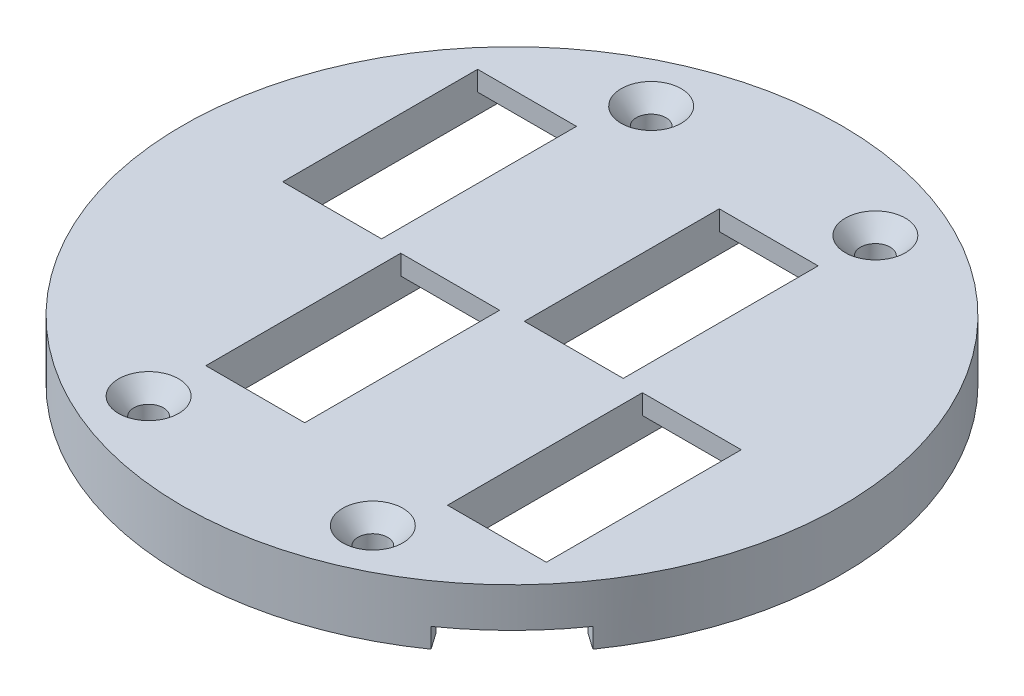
ISO-10303-21;
HEADER;
FILE_DESCRIPTION(('STEP AP214'),'2;1');
FILE_NAME('part.step','',(''),(''),'','','');
FILE_SCHEMA(('AUTOMOTIVE_DESIGN { 1 0 10303 214 1 1 1 1 }'));
ENDSEC;
DATA;
#1=APPLICATION_CONTEXT('core data for automotive mechanical design processes');
#2=APPLICATION_PROTOCOL_DEFINITION('international standard','automotive_design',2000,#1);
#3=PRODUCT_CONTEXT('',#1,'mechanical');
#4=PRODUCT('Part','Part','',(#3));
#5=PRODUCT_RELATED_PRODUCT_CATEGORY('part','',(#4));
#6=PRODUCT_DEFINITION_FORMATION('','',#4);
#7=PRODUCT_DEFINITION_CONTEXT('part definition',#1,'design');
#8=PRODUCT_DEFINITION('design','',#6,#7);
#9=PRODUCT_DEFINITION_SHAPE('','',#8);
#10=(LENGTH_UNIT() NAMED_UNIT(*) SI_UNIT(.MILLI.,.METRE.));
#11=(NAMED_UNIT(*) PLANE_ANGLE_UNIT() SI_UNIT($,.RADIAN.));
#12=(NAMED_UNIT(*) SI_UNIT($,.STERADIAN.) SOLID_ANGLE_UNIT());
#13=UNCERTAINTY_MEASURE_WITH_UNIT(LENGTH_MEASURE(1.E-05),#10,'distance_accuracy_value','');
#14=(GEOMETRIC_REPRESENTATION_CONTEXT(3) GLOBAL_UNCERTAINTY_ASSIGNED_CONTEXT((#13)) GLOBAL_UNIT_ASSIGNED_CONTEXT((#10,
#11,#12)) REPRESENTATION_CONTEXT('',''));
#15=CARTESIAN_POINT('',(0.,0.,0.));
#16=DIRECTION('',(0.,0.,1.));
#17=DIRECTION('',(1.,0.,0.));
#18=AXIS2_PLACEMENT_3D('',#15,#16,#17);
#19=CARTESIAN_POINT('',(34.9999999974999,1.5,29.7842712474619));
#20=DIRECTION('',(1.,0.,0.));
#21=DIRECTION('',(0.,0.,-1.));
#22=AXIS2_PLACEMENT_3D('',#19,#20,#21);
#23=PLANE('',#22);
#24=DIRECTION('',(0.,0.,-1.));
#25=VECTOR('',#24,1.);
#26=CARTESIAN_POINT('',(34.9999999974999,-4.5,31.3687742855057));
#27=LINE('',#26,#25);
#28=CARTESIAN_POINT('',(34.9999999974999,-4.5,33.7842712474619));
#29=VERTEX_POINT('',#28);
#30=CARTESIAN_POINT('',(34.9999999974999,-4.5,-3.7872287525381));
#31=VERTEX_POINT('',#30);
#32=EDGE_CURVE('E1002',#29,#31,#27,.T.);
#33=ORIENTED_EDGE('',*,*,#32,.F.);
#34=DIRECTION('',(0.,-1.,0.));
#35=VECTOR('',#34,1.);
#36=CARTESIAN_POINT('',(34.9999999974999,1.85299435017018,33.7842712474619));
#37=LINE('',#36,#35);
#38=CARTESIAN_POINT('',(34.9999999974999,-1.5,33.7842712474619));
#39=VERTEX_POINT('',#38);
#40=EDGE_CURVE('E1148',#39,#29,#37,.T.);
#41=ORIENTED_EDGE('',*,*,#40,.F.);
#42=DIRECTION('',(0.,0.,-1.));
#43=VECTOR('',#42,1.);
#44=CARTESIAN_POINT('',(34.9999999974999,-1.5,31.3687742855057));
#45=LINE('',#44,#43);
#46=CARTESIAN_POINT('',(34.9999999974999,-1.5,29.7842712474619));
#47=VERTEX_POINT('',#46);
#48=EDGE_CURVE('E993',#39,#47,#45,.T.);
#49=ORIENTED_EDGE('',*,*,#48,.T.);
#50=DIRECTION('',(0.,-1.,0.));
#51=VECTOR('',#50,1.);
#52=CARTESIAN_POINT('',(34.9999999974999,1.5,29.7842712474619));
#53=LINE('',#52,#51);
#54=CARTESIAN_POINT('',(34.9999999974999,1.5,29.7842712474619));
#55=VERTEX_POINT('',#54);
#56=EDGE_CURVE('E688',#55,#47,#53,.T.);
#57=ORIENTED_EDGE('',*,*,#56,.F.);
#58=DIRECTION('',(0.,0.,1.));
#59=VECTOR('',#58,1.);
#60=CARTESIAN_POINT('',(34.9999999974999,1.5,29.7842712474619));
#61=LINE('',#60,#59);
#62=CARTESIAN_POINT('',(34.9999999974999,1.5,0.212771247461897));
#63=VERTEX_POINT('',#62);
#64=EDGE_CURVE('E675',#63,#55,#61,.T.);
#65=ORIENTED_EDGE('',*,*,#64,.F.);
#66=DIRECTION('',(0.,-1.,0.));
#67=VECTOR('',#66,1.);
#68=CARTESIAN_POINT('',(34.9999999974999,1.5,0.212771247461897));
#69=LINE('',#68,#67);
#70=CARTESIAN_POINT('',(34.9999999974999,-1.5,0.212771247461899));
#71=VERTEX_POINT('',#70);
#72=EDGE_CURVE('E693',#63,#71,#69,.T.);
#73=ORIENTED_EDGE('',*,*,#72,.T.);
#74=CARTESIAN_POINT('',(34.9999999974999,-1.5,-3.7872287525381));
#75=VERTEX_POINT('',#74);
#76=EDGE_CURVE('E996',#71,#75,#45,.T.);
#77=ORIENTED_EDGE('',*,*,#76,.T.);
#78=DIRECTION('',(0.,1.,0.));
#79=VECTOR('',#78,1.);
#80=CARTESIAN_POINT('',(34.9999999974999,-19.9003796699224,-3.7872287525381));
#81=LINE('',#80,#79);
#82=EDGE_CURVE('E875',#31,#75,#81,.T.);
#83=ORIENTED_EDGE('',*,*,#82,.F.);
#84=EDGE_LOOP('',(#33,#41,#49,#57,#65,#73,#77,#83));
#85=FACE_BOUND('',#84,.T.);
#86=ADVANCED_FACE('F41',(#85),#23,.F.);
#87=CARTESIAN_POINT('',(0.,-7.5,0.));
#88=DIRECTION('',(0.,-1.,0.));
#89=DIRECTION('',(0.,0.,-1.));
#90=AXIS2_PLACEMENT_3D('',#87,#88,#89);
#91=PLANE('',#90);
#92=DIRECTION('',(0.819152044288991,0.,0.573576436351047));
#93=VECTOR('',#92,1.);
#94=CARTESIAN_POINT('',(38.5001460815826,-7.5,26.9580925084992));
#95=LINE('',#94,#93);
#96=CARTESIAN_POINT('',(38.5001460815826,-7.5,26.9580925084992));
#97=VERTEX_POINT('',#96);
#98=CARTESIAN_POINT('',(40.9576022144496,-7.5,28.6788218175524));
#99=VERTEX_POINT('',#98);
#100=EDGE_CURVE('E546',#97,#99,#95,.T.);
#101=ORIENTED_EDGE('',*,*,#100,.F.);
#102=CARTESIAN_POINT('',(0.,-7.5,0.));
#103=DIRECTION('',(0.,-1.,0.));
#104=DIRECTION('',(0.,0.,-1.));
#105=AXIS2_PLACEMENT_3D('',#102,#103,#104);
#106=CIRCLE('',#105,47.);
#107=CARTESIAN_POINT('',(-26.9580925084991,-7.5,-38.5001460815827));
#108=VERTEX_POINT('',#107);
#109=EDGE_CURVE('E570',#108,#97,#106,.T.);
#110=ORIENTED_EDGE('',*,*,#109,.F.);
#111=DIRECTION('',(0.573576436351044,0.,0.819152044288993));
#112=VECTOR('',#111,1.);
#113=CARTESIAN_POINT('',(-26.9580925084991,-7.5,-38.5001460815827));
#114=LINE('',#113,#112);
#115=CARTESIAN_POINT('',(-28.6788218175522,-7.5,-40.9576022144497));
#116=VERTEX_POINT('',#115);
#117=EDGE_CURVE('E1108',#116,#108,#114,.T.);
#118=ORIENTED_EDGE('',*,*,#117,.F.);
#119=CARTESIAN_POINT('',(0.,-7.5,0.));
#120=DIRECTION('',(0.,-1.,0.));
#121=DIRECTION('',(0.,0.,-1.));
#122=AXIS2_PLACEMENT_3D('',#119,#120,#121);
#123=CIRCLE('',#122,50.);
#124=EDGE_CURVE('E563',#116,#99,#123,.T.);
#125=ORIENTED_EDGE('',*,*,#124,.T.);
#126=EDGE_LOOP('',(#101,#110,#118,#125));
#127=FACE_BOUND('',#126,.T.);
#128=ADVANCED_FACE('F1107',(#127),#91,.T.);
#129=CARTESIAN_POINT('',(32.6745010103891,-19.9003796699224,33.7842712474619));
#130=DIRECTION('',(0.,0.,1.));
#131=DIRECTION('',(1.,0.,0.));
#132=AXIS2_PLACEMENT_3D('',#129,#130,#131);
#133=PLANE('',#132);
#134=ORIENTED_EDGE('',*,*,#40,.T.);
#135=DIRECTION('',(1.,0.,0.));
#136=VECTOR('',#135,1.);
#137=CARTESIAN_POINT('',(32.6745010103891,-4.5,33.7842712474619));
#138=LINE('',#137,#136);
#139=CARTESIAN_POINT('',(19.9999999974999,-4.5,33.7842712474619));
#140=VERTEX_POINT('',#139);
#141=EDGE_CURVE('E759',#140,#29,#138,.T.);
#142=ORIENTED_EDGE('',*,*,#141,.F.);
#143=DIRECTION('',(0.,1.,0.));
#144=VECTOR('',#143,1.);
#145=CARTESIAN_POINT('',(19.9999999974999,-19.9003796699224,33.7842712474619));
#146=LINE('',#145,#144);
#147=CARTESIAN_POINT('',(19.9999999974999,-1.5,33.7842712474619));
#148=VERTEX_POINT('',#147);
#149=EDGE_CURVE('E724',#140,#148,#146,.T.);
#150=ORIENTED_EDGE('',*,*,#149,.T.);
#151=DIRECTION('',(1.,0.,0.));
#152=VECTOR('',#151,1.);
#153=CARTESIAN_POINT('',(32.6745010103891,-1.5,33.7842712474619));
#154=LINE('',#153,#152);
#155=EDGE_CURVE('E755',#148,#39,#154,.T.);
#156=ORIENTED_EDGE('',*,*,#155,.T.);
#157=EDGE_LOOP('',(#134,#142,#150,#156));
#158=FACE_BOUND('',#157,.T.);
#159=ADVANCED_FACE('F1266',(#158),#133,.F.);
#160=CARTESIAN_POINT('',(-34.9999999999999,1.5,-0.212771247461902));
#161=DIRECTION('',(-1.,0.,0.));
#162=DIRECTION('',(0.,0.,1.));
#163=AXIS2_PLACEMENT_3D('',#160,#161,#162);
#164=PLANE('',#163);
#165=DIRECTION('',(0.,0.,1.));
#166=VECTOR('',#165,1.);
#167=CARTESIAN_POINT('',(-34.9999999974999,-4.5,31.3687742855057));
#168=LINE('',#167,#166);
#169=CARTESIAN_POINT('',(-34.9999999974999,-4.5,-33.7842712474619));
#170=VERTEX_POINT('',#169);
#171=CARTESIAN_POINT('',(-34.9999999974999,-4.5,3.7872287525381));
#172=VERTEX_POINT('',#171);
#173=EDGE_CURVE('E982',#170,#172,#168,.T.);
#174=ORIENTED_EDGE('',*,*,#173,.F.);
#175=DIRECTION('',(0.,-1.,0.));
#176=VECTOR('',#175,1.);
#177=CARTESIAN_POINT('',(-34.9999999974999,1.85299435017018,-33.7842712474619));
#178=LINE('',#177,#176);
#179=CARTESIAN_POINT('',(-34.9999999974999,-1.5,-33.7842712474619));
#180=VERTEX_POINT('',#179);
#181=EDGE_CURVE('E1145',#180,#170,#178,.T.);
#182=ORIENTED_EDGE('',*,*,#181,.F.);
#183=DIRECTION('',(0.,0.,1.));
#184=VECTOR('',#183,1.);
#185=CARTESIAN_POINT('',(-34.9999999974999,-1.5,31.3687742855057));
#186=LINE('',#185,#184);
#187=CARTESIAN_POINT('',(-34.9999999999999,-1.5,-29.7842712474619));
#188=VERTEX_POINT('',#187);
#189=EDGE_CURVE('E967',#180,#188,#186,.T.);
#190=ORIENTED_EDGE('',*,*,#189,.T.);
#191=DIRECTION('',(0.,-1.,0.));
#192=VECTOR('',#191,1.);
#193=CARTESIAN_POINT('',(-34.9999999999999,1.5,-29.7842712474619));
#194=LINE('',#193,#192);
#195=CARTESIAN_POINT('',(-34.9999999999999,1.5,-29.7842712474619));
#196=VERTEX_POINT('',#195);
#197=EDGE_CURVE('E607',#196,#188,#194,.T.);
#198=ORIENTED_EDGE('',*,*,#197,.F.);
#199=DIRECTION('',(0.,0.,-1.));
#200=VECTOR('',#199,1.);
#201=CARTESIAN_POINT('',(-34.9999999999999,1.5,-0.212771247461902));
#202=LINE('',#201,#200);
#203=CARTESIAN_POINT('',(-34.9999999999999,1.5,-0.212771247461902));
#204=VERTEX_POINT('',#203);
#205=EDGE_CURVE('E592',#204,#196,#202,.T.);
#206=ORIENTED_EDGE('',*,*,#205,.F.);
#207=DIRECTION('',(0.,-1.,0.));
#208=VECTOR('',#207,1.);
#209=CARTESIAN_POINT('',(-34.9999999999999,1.5,-0.212771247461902));
#210=LINE('',#209,#208);
#211=CARTESIAN_POINT('',(-34.9999999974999,-1.5,-0.212771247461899));
#212=VERTEX_POINT('',#211);
#213=EDGE_CURVE('E610',#204,#212,#210,.T.);
#214=ORIENTED_EDGE('',*,*,#213,.T.);
#215=CARTESIAN_POINT('',(-34.9999999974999,-1.5,3.7872287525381));
#216=VERTEX_POINT('',#215);
#217=EDGE_CURVE('E970',#212,#216,#186,.T.);
#218=ORIENTED_EDGE('',*,*,#217,.T.);
#219=DIRECTION('',(0.,1.,0.));
#220=VECTOR('',#219,1.);
#221=CARTESIAN_POINT('',(-34.9999999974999,-19.9003796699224,3.7872287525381));
#222=LINE('',#221,#220);
#223=EDGE_CURVE('E815',#172,#216,#222,.T.);
#224=ORIENTED_EDGE('',*,*,#223,.F.);
#225=EDGE_LOOP('',(#174,#182,#190,#198,#206,#214,#218,#224));
#226=FACE_BOUND('',#225,.T.);
#227=ADVANCED_FACE('F1377',(#226),#164,.F.);
#228=CARTESIAN_POINT('',(-19.9999999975,-19.9003796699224,-33.7842712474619));
#229=DIRECTION('',(0.,0.,-1.));
#230=DIRECTION('',(-1.,0.,0.));
#231=AXIS2_PLACEMENT_3D('',#228,#229,#230);
#232=PLANE('',#231);
#233=ORIENTED_EDGE('',*,*,#181,.T.);
#234=DIRECTION('',(-1.,0.,0.));
#235=VECTOR('',#234,1.);
#236=CARTESIAN_POINT('',(-19.9999999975,-4.5,-33.7842712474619));
#237=LINE('',#236,#235);
#238=CARTESIAN_POINT('',(-19.9999999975,-4.5,-33.7842712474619));
#239=VERTEX_POINT('',#238);
#240=EDGE_CURVE('E789',#239,#170,#237,.T.);
#241=ORIENTED_EDGE('',*,*,#240,.F.);
#242=DIRECTION('',(0.,1.,0.));
#243=VECTOR('',#242,1.);
#244=CARTESIAN_POINT('',(-19.9999999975,-19.9003796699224,-33.7842712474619));
#245=LINE('',#244,#243);
#246=CARTESIAN_POINT('',(-19.9999999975,-1.5,-33.7842712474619));
#247=VERTEX_POINT('',#246);
#248=EDGE_CURVE('E777',#239,#247,#245,.T.);
#249=ORIENTED_EDGE('',*,*,#248,.T.);
#250=DIRECTION('',(-1.,0.,0.));
#251=VECTOR('',#250,1.);
#252=CARTESIAN_POINT('',(-19.9999999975,-1.5,-33.7842712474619));
#253=LINE('',#252,#251);
#254=EDGE_CURVE('E786',#247,#180,#253,.T.);
#255=ORIENTED_EDGE('',*,*,#254,.T.);
#256=EDGE_LOOP('',(#233,#241,#249,#255));
#257=FACE_BOUND('',#256,.T.);
#258=ADVANCED_FACE('F1340',(#257),#232,.F.);
#259=CARTESIAN_POINT('',(0.,-7.5,0.));
#260=DIRECTION('',(0.,1.,0.));
#261=DIRECTION('',(0.,0.,1.));
#262=AXIS2_PLACEMENT_3D('',#259,#260,#261);
#263=CYLINDRICAL_SURFACE('',#262,47.);
#264=DIRECTION('',(0.,-1.,0.));
#265=VECTOR('',#264,1.);
#266=CARTESIAN_POINT('',(38.5001460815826,15.2982964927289,26.9580925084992));
#267=LINE('',#266,#265);
#268=CARTESIAN_POINT('',(38.5001460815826,-4.5,26.9580925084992));
#269=VERTEX_POINT('',#268);
#270=EDGE_CURVE('E1101',#269,#97,#267,.T.);
#271=ORIENTED_EDGE('',*,*,#270,.F.);
#272=CARTESIAN_POINT('',(0.,-4.5,0.));
#273=DIRECTION('',(0.,-1.,0.));
#274=DIRECTION('',(0.,0.,-1.));
#275=AXIS2_PLACEMENT_3D('',#272,#273,#274);
#276=CIRCLE('',#275,47.);
#277=CARTESIAN_POINT('',(37.9999999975,-4.5,27.6586333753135));
#278=VERTEX_POINT('',#277);
#279=EDGE_CURVE('E1122',#269,#278,#276,.T.);
#280=ORIENTED_EDGE('',*,*,#279,.T.);
#281=DIRECTION('',(0.,1.,0.));
#282=VECTOR('',#281,1.);
#283=CARTESIAN_POINT('',(37.9999999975,-98.5590830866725,27.6586333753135));
#284=LINE('',#283,#282);
#285=CARTESIAN_POINT('',(37.9999999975,-1.5,27.6586333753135));
#286=VERTEX_POINT('',#285);
#287=EDGE_CURVE('E978',#278,#286,#284,.T.);
#288=ORIENTED_EDGE('',*,*,#287,.T.);
#289=CARTESIAN_POINT('',(0.,-1.5,0.));
#290=DIRECTION('',(0.,1.,0.));
#291=DIRECTION('',(0.,0.,1.));
#292=AXIS2_PLACEMENT_3D('',#289,#290,#291);
#293=CIRCLE('',#292,47.);
#294=CARTESIAN_POINT('',(37.9999999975,-1.5,-27.6586333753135));
#295=VERTEX_POINT('',#294);
#296=EDGE_CURVE('E711',#286,#295,#293,.T.);
#297=ORIENTED_EDGE('',*,*,#296,.T.);
#298=DIRECTION('',(0.,1.,0.));
#299=VECTOR('',#298,1.);
#300=CARTESIAN_POINT('',(37.9999999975,-98.5590830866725,-27.6586333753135));
#301=LINE('',#300,#299);
#302=CARTESIAN_POINT('',(37.9999999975,-4.50000000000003,-27.6586333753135));
#303=VERTEX_POINT('',#302);
#304=EDGE_CURVE('E992',#303,#295,#301,.T.);
#305=ORIENTED_EDGE('',*,*,#304,.F.);
#306=CARTESIAN_POINT('',(0.,-4.5,0.));
#307=DIRECTION('',(0.,-1.,0.));
#308=DIRECTION('',(0.,0.,-1.));
#309=AXIS2_PLACEMENT_3D('',#306,#307,#308);
#310=CIRCLE('',#309,47.);
#311=CARTESIAN_POINT('',(34.9999999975,-4.50000000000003,-31.3687742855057));
#312=VERTEX_POINT('',#311);
#313=EDGE_CURVE('E998',#312,#303,#310,.T.);
#314=ORIENTED_EDGE('',*,*,#313,.F.);
#315=DIRECTION('',(0.,1.,0.));
#316=VECTOR('',#315,1.);
#317=CARTESIAN_POINT('',(34.9999999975,-98.5590830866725,-31.3687742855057));
#318=LINE('',#317,#316);
#319=CARTESIAN_POINT('',(34.9999999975,-1.5,-31.3687742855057));
#320=VERTEX_POINT('',#319);
#321=EDGE_CURVE('E995',#312,#320,#318,.T.);
#322=ORIENTED_EDGE('',*,*,#321,.T.);
#323=CARTESIAN_POINT('',(19.9999999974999,-1.5,-42.5323406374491));
#324=VERTEX_POINT('',#323);
#325=EDGE_CURVE('E1293',#320,#324,#293,.T.);
#326=ORIENTED_EDGE('',*,*,#325,.T.);
#327=DIRECTION('',(0.,1.,0.));
#328=VECTOR('',#327,1.);
#329=CARTESIAN_POINT('',(19.9999999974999,-98.5590830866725,-42.5323406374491));
#330=LINE('',#329,#328);
#331=CARTESIAN_POINT('',(19.9999999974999,-4.50000000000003,-42.5323406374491));
#332=VERTEX_POINT('',#331);
#333=EDGE_CURVE('E924',#332,#324,#330,.T.);
#334=ORIENTED_EDGE('',*,*,#333,.F.);
#335=CARTESIAN_POINT('',(0.,-4.5,0.));
#336=DIRECTION('',(0.,-1.,0.));
#337=DIRECTION('',(0.,0.,-1.));
#338=AXIS2_PLACEMENT_3D('',#335,#336,#337);
#339=CIRCLE('',#338,47.);
#340=CARTESIAN_POINT('',(16.666666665,-4.50000000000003,-43.9456735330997));
#341=VERTEX_POINT('',#340);
#342=EDGE_CURVE('E929',#341,#332,#339,.T.);
#343=ORIENTED_EDGE('',*,*,#342,.F.);
#344=DIRECTION('',(0.,1.,0.));
#345=VECTOR('',#344,1.);
#346=CARTESIAN_POINT('',(16.666666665,-98.5590830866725,-43.9456735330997));
#347=LINE('',#346,#345);
#348=CARTESIAN_POINT('',(16.666666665,-1.5,-43.9456735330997));
#349=VERTEX_POINT('',#348);
#350=EDGE_CURVE('E927',#341,#349,#347,.T.);
#351=ORIENTED_EDGE('',*,*,#350,.T.);
#352=CARTESIAN_POINT('',(1.66666666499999,-1.5,-46.9704398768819));
#353=VERTEX_POINT('',#352);
#354=EDGE_CURVE('E1447',#349,#353,#293,.T.);
#355=ORIENTED_EDGE('',*,*,#354,.T.);
#356=DIRECTION('',(0.,1.,0.));
#357=VECTOR('',#356,1.);
#358=CARTESIAN_POINT('',(1.66666666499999,-98.5590830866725,-46.9704398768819));
#359=LINE('',#358,#357);
#360=CARTESIAN_POINT('',(1.66666666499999,-4.50000000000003,-46.9704398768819));
#361=VERTEX_POINT('',#360);
#362=EDGE_CURVE('E1060',#361,#353,#359,.T.);
#363=ORIENTED_EDGE('',*,*,#362,.F.);
#364=CARTESIAN_POINT('',(0.,-4.5,0.));
#365=DIRECTION('',(0.,-1.,0.));
#366=DIRECTION('',(0.,0.,-1.));
#367=AXIS2_PLACEMENT_3D('',#364,#365,#366);
#368=CIRCLE('',#367,47.);
#369=CARTESIAN_POINT('',(-1.66666666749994,-4.5,-46.9704398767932));
#370=VERTEX_POINT('',#369);
#371=EDGE_CURVE('E1039',#370,#361,#368,.T.);
#372=ORIENTED_EDGE('',*,*,#371,.F.);
#373=DIRECTION('',(0.,1.,0.));
#374=VECTOR('',#373,1.);
#375=CARTESIAN_POINT('',(-1.66666666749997,-98.5590830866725,-46.9704398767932));
#376=LINE('',#375,#374);
#377=CARTESIAN_POINT('',(-1.66666666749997,-1.5,-46.9704398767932));
#378=VERTEX_POINT('',#377);
#379=EDGE_CURVE('E1036',#370,#378,#376,.T.);
#380=ORIENTED_EDGE('',*,*,#379,.T.);
#381=CARTESIAN_POINT('',(-16.666666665,-1.5,-43.9456735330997));
#382=VERTEX_POINT('',#381);
#383=EDGE_CURVE('E712',#378,#382,#293,.T.);
#384=ORIENTED_EDGE('',*,*,#383,.T.);
#385=DIRECTION('',(0.,1.,0.));
#386=VECTOR('',#385,1.);
#387=CARTESIAN_POINT('',(-16.666666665,-98.5590830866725,-43.9456735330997));
#388=LINE('',#387,#386);
#389=CARTESIAN_POINT('',(-16.666666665,-4.50000000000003,-43.9456735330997));
#390=VERTEX_POINT('',#389);
#391=EDGE_CURVE('E890',#390,#382,#388,.T.);
#392=ORIENTED_EDGE('',*,*,#391,.F.);
#393=CARTESIAN_POINT('',(0.,-4.5,0.));
#394=DIRECTION('',(0.,-1.,0.));
#395=DIRECTION('',(0.,0.,-1.));
#396=AXIS2_PLACEMENT_3D('',#393,#394,#395);
#397=CIRCLE('',#396,47.);
#398=CARTESIAN_POINT('',(-26.9580925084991,-4.5,-38.5001460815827));
#399=VERTEX_POINT('',#398);
#400=EDGE_CURVE('E891',#399,#390,#397,.T.);
#401=ORIENTED_EDGE('',*,*,#400,.F.);
#402=DIRECTION('',(0.,-1.,0.));
#403=VECTOR('',#402,1.);
#404=CARTESIAN_POINT('',(-26.9580925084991,15.2982964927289,-38.5001460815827));
#405=LINE('',#404,#403);
#406=EDGE_CURVE('E1103',#399,#108,#405,.T.);
#407=ORIENTED_EDGE('',*,*,#406,.T.);
#408=ORIENTED_EDGE('',*,*,#109,.T.);
#409=EDGE_LOOP('',(#271,#280,#288,#297,#305,#314,#322,#326,#334,#343,#351,#355,#363,#372,#380,
#384,#392,#401,#407,#408));
#410=FACE_BOUND('',#409,.T.);
#411=ADVANCED_FACE('F1099',(#410),#263,.F.);
#412=DIRECTION('',(0.,-1.,0.));
#413=VECTOR('',#412,1.);
#414=CARTESIAN_POINT('',(26.9580925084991,15.2982964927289,38.5001460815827));
#415=LINE('',#414,#413);
#416=CARTESIAN_POINT('',(26.9580925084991,-4.5,38.5001460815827));
#417=VERTEX_POINT('',#416);
#418=CARTESIAN_POINT('',(26.9580925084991,-7.5,38.5001460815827));
#419=VERTEX_POINT('',#418);
#420=EDGE_CURVE('E545',#417,#419,#415,.T.);
#421=ORIENTED_EDGE('',*,*,#420,.T.);
#422=CARTESIAN_POINT('',(-38.5001460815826,-7.5,-26.9580925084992));
#423=VERTEX_POINT('',#422);
#424=EDGE_CURVE('E554',#419,#423,#106,.T.);
#425=ORIENTED_EDGE('',*,*,#424,.T.);
#426=DIRECTION('',(0.,-1.,0.));
#427=VECTOR('',#426,1.);
#428=CARTESIAN_POINT('',(-38.5001460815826,15.2982964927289,-26.9580925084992));
#429=LINE('',#428,#427);
#430=CARTESIAN_POINT('',(-38.5001460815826,-4.5,-26.9580925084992));
#431=VERTEX_POINT('',#430);
#432=EDGE_CURVE('E1136',#431,#423,#429,.T.);
#433=ORIENTED_EDGE('',*,*,#432,.F.);
#434=CARTESIAN_POINT('',(0.,-4.5,0.));
#435=DIRECTION('',(0.,-1.,0.));
#436=DIRECTION('',(0.,0.,-1.));
#437=AXIS2_PLACEMENT_3D('',#434,#435,#436);
#438=CIRCLE('',#437,47.);
#439=CARTESIAN_POINT('',(-37.9999999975,-4.5,-27.6586333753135));
#440=VERTEX_POINT('',#439);
#441=EDGE_CURVE('E1142',#431,#440,#438,.T.);
#442=ORIENTED_EDGE('',*,*,#441,.T.);
#443=DIRECTION('',(0.,1.,0.));
#444=VECTOR('',#443,1.);
#445=CARTESIAN_POINT('',(-37.9999999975,-98.5590830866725,-27.6586333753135));
#446=LINE('',#445,#444);
#447=CARTESIAN_POINT('',(-37.9999999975,-1.5,-27.6586333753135));
#448=VERTEX_POINT('',#447);
#449=EDGE_CURVE('E974',#440,#448,#446,.T.);
#450=ORIENTED_EDGE('',*,*,#449,.T.);
#451=CARTESIAN_POINT('',(-37.9999999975,-1.5,27.6586333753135));
#452=VERTEX_POINT('',#451);
#453=EDGE_CURVE('E1517',#448,#452,#293,.T.);
#454=ORIENTED_EDGE('',*,*,#453,.T.);
#455=DIRECTION('',(0.,1.,0.));
#456=VECTOR('',#455,1.);
#457=CARTESIAN_POINT('',(-37.9999999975,-98.5590830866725,27.6586333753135));
#458=LINE('',#457,#456);
#459=CARTESIAN_POINT('',(-37.9999999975,-4.50000000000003,27.6586333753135));
#460=VERTEX_POINT('',#459);
#461=EDGE_CURVE('E975',#460,#452,#458,.T.);
#462=ORIENTED_EDGE('',*,*,#461,.F.);
#463=CARTESIAN_POINT('',(0.,-4.5,0.));
#464=DIRECTION('',(0.,-1.,0.));
#465=DIRECTION('',(0.,0.,-1.));
#466=AXIS2_PLACEMENT_3D('',#463,#464,#465);
#467=CIRCLE('',#466,47.);
#468=CARTESIAN_POINT('',(-34.9999999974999,-4.5,31.3687742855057));
#469=VERTEX_POINT('',#468);
#470=EDGE_CURVE('E979',#469,#460,#467,.T.);
#471=ORIENTED_EDGE('',*,*,#470,.F.);
#472=DIRECTION('',(0.,1.,0.));
#473=VECTOR('',#472,1.);
#474=CARTESIAN_POINT('',(-34.9999999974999,-98.5590830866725,31.3687742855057));
#475=LINE('',#474,#473);
#476=CARTESIAN_POINT('',(-34.9999999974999,-1.5,31.3687742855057));
#477=VERTEX_POINT('',#476);
#478=EDGE_CURVE('E959',#469,#477,#475,.T.);
#479=ORIENTED_EDGE('',*,*,#478,.T.);
#480=CARTESIAN_POINT('',(-19.9999999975,-1.5,42.5323406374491));
#481=VERTEX_POINT('',#480);
#482=EDGE_CURVE('E1519',#477,#481,#293,.T.);
#483=ORIENTED_EDGE('',*,*,#482,.T.);
#484=DIRECTION('',(0.,1.,0.));
#485=VECTOR('',#484,1.);
#486=CARTESIAN_POINT('',(-19.9999999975,-98.5590830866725,42.5323406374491));
#487=LINE('',#486,#485);
#488=CARTESIAN_POINT('',(-19.9999999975,-4.50000000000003,42.5323406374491));
#489=VERTEX_POINT('',#488);
#490=EDGE_CURVE('E901',#489,#481,#487,.T.);
#491=ORIENTED_EDGE('',*,*,#490,.F.);
#492=CARTESIAN_POINT('',(0.,-4.5,0.));
#493=DIRECTION('',(0.,-1.,0.));
#494=DIRECTION('',(0.,0.,-1.));
#495=AXIS2_PLACEMENT_3D('',#492,#493,#494);
#496=CIRCLE('',#495,47.);
#497=CARTESIAN_POINT('',(-16.666666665,-4.50000000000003,43.9456735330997));
#498=VERTEX_POINT('',#497);
#499=EDGE_CURVE('E906',#498,#489,#496,.T.);
#500=ORIENTED_EDGE('',*,*,#499,.F.);
#501=DIRECTION('',(0.,1.,0.));
#502=VECTOR('',#501,1.);
#503=CARTESIAN_POINT('',(-16.666666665,-98.5590830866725,43.9456735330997));
#504=LINE('',#503,#502);
#505=CARTESIAN_POINT('',(-16.666666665,-1.5,43.9456735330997));
#506=VERTEX_POINT('',#505);
#507=EDGE_CURVE('E904',#498,#506,#504,.T.);
#508=ORIENTED_EDGE('',*,*,#507,.T.);
#509=CARTESIAN_POINT('',(-1.66666666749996,-1.5,46.9704398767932));
#510=VERTEX_POINT('',#509);
#511=EDGE_CURVE('E696',#506,#510,#293,.T.);
#512=ORIENTED_EDGE('',*,*,#511,.T.);
#513=DIRECTION('',(0.,1.,0.));
#514=VECTOR('',#513,1.);
#515=CARTESIAN_POINT('',(-1.66666666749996,-98.5590830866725,46.9704398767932));
#516=LINE('',#515,#514);
#517=CARTESIAN_POINT('',(-1.66666666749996,-4.5,46.9704398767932));
#518=VERTEX_POINT('',#517);
#519=EDGE_CURVE('E1054',#518,#510,#516,.T.);
#520=ORIENTED_EDGE('',*,*,#519,.F.);
#521=CARTESIAN_POINT('',(0.,-4.5,0.));
#522=DIRECTION('',(0.,-1.,0.));
#523=DIRECTION('',(0.,0.,-1.));
#524=AXIS2_PLACEMENT_3D('',#521,#522,#523);
#525=CIRCLE('',#524,47.);
#526=CARTESIAN_POINT('',(1.66666666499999,-4.5,46.9704398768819));
#527=VERTEX_POINT('',#526);
#528=EDGE_CURVE('E1048',#527,#518,#525,.T.);
#529=ORIENTED_EDGE('',*,*,#528,.F.);
#530=DIRECTION('',(0.,1.,0.));
#531=VECTOR('',#530,1.);
#532=CARTESIAN_POINT('',(1.66666666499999,-98.5590830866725,46.9704398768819));
#533=LINE('',#532,#531);
#534=CARTESIAN_POINT('',(1.66666666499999,-1.5,46.9704398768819));
#535=VERTEX_POINT('',#534);
#536=EDGE_CURVE('E1019',#527,#535,#533,.T.);
#537=ORIENTED_EDGE('',*,*,#536,.T.);
#538=CARTESIAN_POINT('',(16.666666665,-1.5,43.9456735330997));
#539=VERTEX_POINT('',#538);
#540=EDGE_CURVE('E706',#535,#539,#293,.T.);
#541=ORIENTED_EDGE('',*,*,#540,.T.);
#542=DIRECTION('',(0.,1.,0.));
#543=VECTOR('',#542,1.);
#544=CARTESIAN_POINT('',(16.666666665,-98.5590830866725,43.9456735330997));
#545=LINE('',#544,#543);
#546=CARTESIAN_POINT('',(16.666666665,-4.50000000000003,43.9456735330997));
#547=VERTEX_POINT('',#546);
#548=EDGE_CURVE('E1015',#547,#539,#545,.T.);
#549=ORIENTED_EDGE('',*,*,#548,.F.);
#550=CARTESIAN_POINT('',(0.,-4.5,0.));
#551=DIRECTION('',(0.,-1.,0.));
#552=DIRECTION('',(0.,0.,-1.));
#553=AXIS2_PLACEMENT_3D('',#550,#551,#552);
#554=CIRCLE('',#553,47.);
#555=EDGE_CURVE('E1016',#417,#547,#554,.T.);
#556=ORIENTED_EDGE('',*,*,#555,.F.);
#557=EDGE_LOOP('',(#421,#425,#433,#442,#450,#454,#462,#471,#479,#483,#491,#500,#508,#512,#520,
#529,#537,#541,#549,#556));
#558=FACE_BOUND('',#557,.T.);
#559=ADVANCED_FACE('F1205',(#558),#263,.F.);
#560=CARTESIAN_POINT('',(19.9999999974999,1.5,29.7842712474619));
#561=DIRECTION('',(-1.,0.,0.));
#562=DIRECTION('',(0.,0.,1.));
#563=AXIS2_PLACEMENT_3D('',#560,#561,#562);
#564=PLANE('',#563);
#565=ORIENTED_EDGE('',*,*,#149,.F.);
#566=DIRECTION('',(0.,0.,1.));
#567=VECTOR('',#566,1.);
#568=CARTESIAN_POINT('',(19.9999999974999,-4.5,-35.4718287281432));
#569=LINE('',#568,#567);
#570=CARTESIAN_POINT('',(19.9999999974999,-4.5,-3.78722875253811));
#571=VERTEX_POINT('',#570);
#572=EDGE_CURVE('E1069',#571,#140,#569,.T.);
#573=ORIENTED_EDGE('',*,*,#572,.F.);
#574=DIRECTION('',(0.,1.,0.));
#575=VECTOR('',#574,1.);
#576=CARTESIAN_POINT('',(19.9999999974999,-19.9003796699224,-3.78722875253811));
#577=LINE('',#576,#575);
#578=CARTESIAN_POINT('',(19.9999999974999,-1.5,-3.78722875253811));
#579=VERTEX_POINT('',#578);
#580=EDGE_CURVE('E874',#571,#579,#577,.T.);
#581=ORIENTED_EDGE('',*,*,#580,.T.);
#582=DIRECTION('',(0.,0.,1.));
#583=VECTOR('',#582,1.);
#584=CARTESIAN_POINT('',(19.9999999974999,-1.5,-35.4718287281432));
#585=LINE('',#584,#583);
#586=CARTESIAN_POINT('',(19.9999999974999,-1.5,0.212771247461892));
#587=VERTEX_POINT('',#586);
#588=EDGE_CURVE('E1070',#579,#587,#585,.T.);
#589=ORIENTED_EDGE('',*,*,#588,.T.);
#590=DIRECTION('',(0.,-1.,0.));
#591=VECTOR('',#590,1.);
#592=CARTESIAN_POINT('',(19.9999999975,1.5,0.212771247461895));
#593=LINE('',#592,#591);
#594=CARTESIAN_POINT('',(19.9999999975,1.5,0.212771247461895));
#595=VERTEX_POINT('',#594);
#596=EDGE_CURVE('E697',#595,#587,#593,.T.);
#597=ORIENTED_EDGE('',*,*,#596,.F.);
#598=DIRECTION('',(0.,0.,-1.));
#599=VECTOR('',#598,1.);
#600=CARTESIAN_POINT('',(19.9999999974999,1.5,29.7842712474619));
#601=LINE('',#600,#599);
#602=CARTESIAN_POINT('',(19.9999999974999,1.5,29.7842712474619));
#603=VERTEX_POINT('',#602);
#604=EDGE_CURVE('E682',#603,#595,#601,.T.);
#605=ORIENTED_EDGE('',*,*,#604,.F.);
#606=DIRECTION('',(0.,-1.,0.));
#607=VECTOR('',#606,1.);
#608=CARTESIAN_POINT('',(19.9999999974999,1.5,29.7842712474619));
#609=LINE('',#608,#607);
#610=CARTESIAN_POINT('',(19.9999999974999,-1.5,29.7842712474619));
#611=VERTEX_POINT('',#610);
#612=EDGE_CURVE('E700',#603,#611,#609,.T.);
#613=ORIENTED_EDGE('',*,*,#612,.T.);
#614=EDGE_CURVE('E1071',#611,#148,#585,.T.);
#615=ORIENTED_EDGE('',*,*,#614,.T.);
#616=EDGE_LOOP('',(#565,#573,#581,#589,#597,#605,#613,#615));
#617=FACE_BOUND('',#616,.T.);
#618=ADVANCED_FACE('F1279',(#617),#564,.F.);
#619=CARTESIAN_POINT('',(0.,-1.5,0.));
#620=DIRECTION('',(0.,1.,0.));
#621=DIRECTION('',(0.,0.,1.));
#622=AXIS2_PLACEMENT_3D('',#619,#620,#621);
#623=PLANE('',#622);
#624=ORIENTED_EDGE('',*,*,#48,.F.);
#625=ORIENTED_EDGE('',*,*,#155,.F.);
#626=ORIENTED_EDGE('',*,*,#614,.F.);
#627=DIRECTION('',(-1.,0.,0.));
#628=VECTOR('',#627,1.);
#629=CARTESIAN_POINT('',(34.9999999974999,-1.5,29.7842712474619));
#630=LINE('',#629,#628);
#631=EDGE_CURVE('E666',#47,#611,#630,.T.);
#632=ORIENTED_EDGE('',*,*,#631,.F.);
#633=EDGE_LOOP('',(#624,#625,#626,#632));
#634=FACE_BOUND('',#633,.T.);
#635=ADVANCED_FACE('F1315',(#634),#623,.F.);
#636=CARTESIAN_POINT('',(-1.66666666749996,1.5,29.7842712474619));
#637=DIRECTION('',(1.,0.,0.));
#638=DIRECTION('',(0.,0.,-1.));
#639=AXIS2_PLACEMENT_3D('',#636,#637,#638);
#640=PLANE('',#639);
#641=DIRECTION('',(0.,1.,0.));
#642=VECTOR('',#641,1.);
#643=CARTESIAN_POINT('',(-1.66666666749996,-19.9003796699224,36.7842712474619));
#644=LINE('',#643,#642);
#645=CARTESIAN_POINT('',(-1.66666666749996,-4.5,36.7842712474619));
#646=VERTEX_POINT('',#645);
#647=CARTESIAN_POINT('',(-1.66666666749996,-1.5,36.7842712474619));
#648=VERTEX_POINT('',#647);
#649=EDGE_CURVE('E773',#646,#648,#644,.T.);
#650=ORIENTED_EDGE('',*,*,#649,.F.);
#651=DIRECTION('',(0.,0.,-1.));
#652=VECTOR('',#651,1.);
#653=CARTESIAN_POINT('',(-1.66666666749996,-4.5,46.9704398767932));
#654=LINE('',#653,#652);
#655=EDGE_CURVE('E1043',#518,#646,#654,.T.);
#656=ORIENTED_EDGE('',*,*,#655,.F.);
#657=ORIENTED_EDGE('',*,*,#519,.T.);
#658=DIRECTION('',(0.,0.,-1.));
#659=VECTOR('',#658,1.);
#660=CARTESIAN_POINT('',(-1.66666666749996,-1.5,46.9704398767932));
#661=LINE('',#660,#659);
#662=EDGE_CURVE('E1033',#510,#648,#661,.T.);
#663=ORIENTED_EDGE('',*,*,#662,.T.);
#664=EDGE_LOOP('',(#650,#656,#657,#663));
#665=FACE_BOUND('',#664,.T.);
#666=ADVANCED_FACE('F1334',(#665),#640,.F.);
#667=DIRECTION('',(0.,1.,0.));
#668=VECTOR('',#667,1.);
#669=CARTESIAN_POINT('',(-1.66666666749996,-19.9003796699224,33.7842712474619));
#670=LINE('',#669,#668);
#671=CARTESIAN_POINT('',(-1.66666666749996,-4.5,33.7842712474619));
#672=VERTEX_POINT('',#671);
#673=CARTESIAN_POINT('',(-1.66666666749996,-1.5,33.7842712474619));
#674=VERTEX_POINT('',#673);
#675=EDGE_CURVE('E763',#672,#674,#670,.T.);
#676=ORIENTED_EDGE('',*,*,#675,.T.);
#677=CARTESIAN_POINT('',(-1.66666666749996,-1.5,29.7842712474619));
#678=VERTEX_POINT('',#677);
#679=EDGE_CURVE('E1037',#674,#678,#661,.T.);
#680=ORIENTED_EDGE('',*,*,#679,.T.);
#681=DIRECTION('',(0.,-1.,0.));
#682=VECTOR('',#681,1.);
#683=CARTESIAN_POINT('',(-1.66666666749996,1.5,29.7842712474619));
#684=LINE('',#683,#682);
#685=CARTESIAN_POINT('',(-1.66666666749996,1.5,29.7842712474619));
#686=VERTEX_POINT('',#685);
#687=EDGE_CURVE('E628',#686,#678,#684,.T.);
#688=ORIENTED_EDGE('',*,*,#687,.F.);
#689=DIRECTION('',(0.,0.,1.));
#690=VECTOR('',#689,1.);
#691=CARTESIAN_POINT('',(-1.66666666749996,1.5,29.7842712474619));
#692=LINE('',#691,#690);
#693=CARTESIAN_POINT('',(-1.66666666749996,1.5,0.212771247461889));
#694=VERTEX_POINT('',#693);
#695=EDGE_CURVE('E615',#694,#686,#692,.T.);
#696=ORIENTED_EDGE('',*,*,#695,.F.);
#697=DIRECTION('',(0.,-1.,0.));
#698=VECTOR('',#697,1.);
#699=CARTESIAN_POINT('',(-1.66666666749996,1.5,0.212771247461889));
#700=LINE('',#699,#698);
#701=CARTESIAN_POINT('',(-1.66666666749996,-1.5,0.212771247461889));
#702=VERTEX_POINT('',#701);
#703=EDGE_CURVE('E633',#694,#702,#700,.T.);
#704=ORIENTED_EDGE('',*,*,#703,.T.);
#705=CARTESIAN_POINT('',(-1.66666666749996,-1.5,-3.78722875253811));
#706=VERTEX_POINT('',#705);
#707=EDGE_CURVE('E1038',#702,#706,#661,.T.);
#708=ORIENTED_EDGE('',*,*,#707,.T.);
#709=DIRECTION('',(0.,1.,0.));
#710=VECTOR('',#709,1.);
#711=CARTESIAN_POINT('',(-1.66666666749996,-19.9003796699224,-3.78722875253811));
#712=LINE('',#711,#710);
#713=CARTESIAN_POINT('',(-1.66666666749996,-4.5,-3.78722875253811));
#714=VERTEX_POINT('',#713);
#715=EDGE_CURVE('E837',#714,#706,#712,.T.);
#716=ORIENTED_EDGE('',*,*,#715,.F.);
#717=EDGE_CURVE('E1046',#672,#714,#654,.T.);
#718=ORIENTED_EDGE('',*,*,#717,.F.);
#719=EDGE_LOOP('',(#676,#680,#688,#696,#704,#708,#716,#718));
#720=FACE_BOUND('',#719,.T.);
#721=ADVANCED_FACE('F1391',(#720),#640,.F.);
#722=CARTESIAN_POINT('',(-16.6666666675,1.5,29.7842712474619));
#723=DIRECTION('',(-1.,0.,0.));
#724=DIRECTION('',(0.,0.,1.));
#725=AXIS2_PLACEMENT_3D('',#722,#723,#724);
#726=PLANE('',#725);
#727=DIRECTION('',(0.,1.,0.));
#728=VECTOR('',#727,1.);
#729=CARTESIAN_POINT('',(-16.666666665,-19.9003796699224,33.7842712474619));
#730=LINE('',#729,#728);
#731=CARTESIAN_POINT('',(-16.666666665,-4.5,33.7842712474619));
#732=VERTEX_POINT('',#731);
#733=CARTESIAN_POINT('',(-16.666666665,-1.5,33.7842712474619));
#734=VERTEX_POINT('',#733);
#735=EDGE_CURVE('E769',#732,#734,#730,.T.);
#736=ORIENTED_EDGE('',*,*,#735,.F.);
#737=DIRECTION('',(0.,0.,1.));
#738=VECTOR('',#737,1.);
#739=CARTESIAN_POINT('',(-16.666666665,-4.5,34.1427403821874));
#740=LINE('',#739,#738);
#741=CARTESIAN_POINT('',(-16.666666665,-4.5,-3.78722875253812));
#742=VERTEX_POINT('',#741);
#743=EDGE_CURVE('E960',#742,#732,#740,.T.);
#744=ORIENTED_EDGE('',*,*,#743,.F.);
#745=DIRECTION('',(0.,1.,0.));
#746=VECTOR('',#745,1.);
#747=CARTESIAN_POINT('',(-16.666666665,-19.9003796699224,-3.78722875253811));
#748=LINE('',#747,#746);
#749=CARTESIAN_POINT('',(-16.666666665,-1.5,-3.78722875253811));
#750=VERTEX_POINT('',#749);
#751=EDGE_CURVE('E836',#742,#750,#748,.T.);
#752=ORIENTED_EDGE('',*,*,#751,.T.);
#753=DIRECTION('',(0.,0.,1.));
#754=VECTOR('',#753,1.);
#755=CARTESIAN_POINT('',(-16.666666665,-1.5,34.1427403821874));
#756=LINE('',#755,#754);
#757=CARTESIAN_POINT('',(-16.666666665,-1.5,0.212771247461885));
#758=VERTEX_POINT('',#757);
#759=EDGE_CURVE('E954',#750,#758,#756,.T.);
#760=ORIENTED_EDGE('',*,*,#759,.T.);
#761=DIRECTION('',(0.,-1.,0.));
#762=VECTOR('',#761,1.);
#763=CARTESIAN_POINT('',(-16.6666666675,1.5,0.212771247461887));
#764=LINE('',#763,#762);
#765=CARTESIAN_POINT('',(-16.6666666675,1.5,0.212771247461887));
#766=VERTEX_POINT('',#765);
#767=EDGE_CURVE('E637',#766,#758,#764,.T.);
#768=ORIENTED_EDGE('',*,*,#767,.F.);
#769=DIRECTION('',(0.,0.,-1.));
#770=VECTOR('',#769,1.);
#771=CARTESIAN_POINT('',(-16.6666666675,1.5,29.7842712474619));
#772=LINE('',#771,#770);
#773=CARTESIAN_POINT('',(-16.6666666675,1.5,29.7842712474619));
#774=VERTEX_POINT('',#773);
#775=EDGE_CURVE('E622',#774,#766,#772,.T.);
#776=ORIENTED_EDGE('',*,*,#775,.F.);
#777=DIRECTION('',(0.,-1.,0.));
#778=VECTOR('',#777,1.);
#779=CARTESIAN_POINT('',(-16.6666666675,1.5,29.7842712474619));
#780=LINE('',#779,#778);
#781=CARTESIAN_POINT('',(-16.666666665,-1.5,29.7842712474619));
#782=VERTEX_POINT('',#781);
#783=EDGE_CURVE('E640',#774,#782,#780,.T.);
#784=ORIENTED_EDGE('',*,*,#783,.T.);
#785=EDGE_CURVE('E955',#782,#734,#756,.T.);
#786=ORIENTED_EDGE('',*,*,#785,.T.);
#787=EDGE_LOOP('',(#736,#744,#752,#760,#768,#776,#784,#786));
#788=FACE_BOUND('',#787,.T.);
#789=ADVANCED_FACE('F1388',(#788),#726,.F.);
#790=DIRECTION('',(-1.,0.,0.));
#791=VECTOR('',#790,1.);
#792=CARTESIAN_POINT('',(-1.66666666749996,-1.5,36.7842712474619));
#793=LINE('',#792,#791);
#794=CARTESIAN_POINT('',(-13.2417296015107,-1.5,36.7842712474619));
#795=VERTEX_POINT('',#794);
#796=EDGE_CURVE('E770',#648,#795,#793,.T.);
#797=ORIENTED_EDGE('',*,*,#796,.F.);
#798=ORIENTED_EDGE('',*,*,#662,.F.);
#799=ORIENTED_EDGE('',*,*,#511,.F.);
#800=DIRECTION('',(0.,0.,1.));
#801=VECTOR('',#800,1.);
#802=CARTESIAN_POINT('',(-16.666666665,-1.5,42.1133439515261));
#803=LINE('',#802,#801);
#804=CARTESIAN_POINT('',(-16.666666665,-1.5,42.1133439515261));
#805=VERTEX_POINT('',#804);
#806=EDGE_CURVE('E902',#805,#506,#803,.T.);
#807=ORIENTED_EDGE('',*,*,#806,.F.);
#808=CARTESIAN_POINT('',(-17.0092592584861,-1.5,38.1280421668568));
#809=DIRECTION('',(0.,1.,0.));
#810=DIRECTION('',(0.,0.,1.));
#811=AXIS2_PLACEMENT_3D('',#808,#809,#810);
#812=CIRCLE('',#811,4.);
#813=EDGE_CURVE('E11',#795,#805,#812,.F.);
#814=ORIENTED_EDGE('',*,*,#813,.F.);
#815=EDGE_LOOP('',(#797,#798,#799,#807,#814));
#816=FACE_BOUND('',#815,.T.);
#817=ADVANCED_FACE('F1335',(#816),#623,.F.);
#818=DIRECTION('',(1.,0.,0.));
#819=VECTOR('',#818,1.);
#820=CARTESIAN_POINT('',(-1.66666666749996,-1.5,33.7842712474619));
#821=LINE('',#820,#819);
#822=EDGE_CURVE('E766',#734,#674,#821,.T.);
#823=ORIENTED_EDGE('',*,*,#822,.F.);
#824=ORIENTED_EDGE('',*,*,#785,.F.);
#825=DIRECTION('',(-1.,0.,0.));
#826=VECTOR('',#825,1.);
#827=CARTESIAN_POINT('',(-1.66666666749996,-1.5,29.7842712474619));
#828=LINE('',#827,#826);
#829=EDGE_CURVE('E606',#678,#782,#828,.T.);
#830=ORIENTED_EDGE('',*,*,#829,.F.);
#831=ORIENTED_EDGE('',*,*,#679,.F.);
#832=EDGE_LOOP('',(#823,#824,#830,#831));
#833=FACE_BOUND('',#832,.T.);
#834=ADVANCED_FACE('F1351',(#833),#623,.F.);
#835=CARTESIAN_POINT('',(-17.0092592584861,-4.5,38.1280421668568));
#836=DIRECTION('',(0.,1.,0.));
#837=DIRECTION('',(0.,0.,1.));
#838=AXIS2_PLACEMENT_3D('',#835,#836,#837);
#839=CYLINDRICAL_SURFACE('',#838,4.);
#840=DIRECTION('',(0.,1.,0.));
#841=VECTOR('',#840,1.);
#842=CARTESIAN_POINT('',(-13.2417296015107,-19.9003796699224,36.7842712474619));
#843=LINE('',#842,#841);
#844=CARTESIAN_POINT('',(-13.2417296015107,-4.5,36.7842712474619));
#845=VERTEX_POINT('',#844);
#846=EDGE_CURVE('E772',#845,#795,#843,.T.);
#847=ORIENTED_EDGE('',*,*,#846,.T.);
#848=ORIENTED_EDGE('',*,*,#813,.T.);
#849=DIRECTION('',(0.,1.,0.));
#850=VECTOR('',#849,1.);
#851=CARTESIAN_POINT('',(-16.666666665,-98.5590830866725,42.1133439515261));
#852=LINE('',#851,#850);
#853=CARTESIAN_POINT('',(-16.666666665,-4.50000000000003,42.1133439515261));
#854=VERTEX_POINT('',#853);
#855=EDGE_CURVE('E905',#854,#805,#852,.T.);
#856=ORIENTED_EDGE('',*,*,#855,.F.);
#857=CARTESIAN_POINT('',(-17.0092592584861,-4.5,38.1280421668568));
#858=DIRECTION('',(0.,-1.,0.));
#859=DIRECTION('',(0.,0.,-1.));
#860=AXIS2_PLACEMENT_3D('',#857,#858,#859);
#861=CIRCLE('',#860,4.);
#862=EDGE_CURVE('E574',#845,#854,#861,.T.);
#863=ORIENTED_EDGE('',*,*,#862,.F.);
#864=EDGE_LOOP('',(#847,#848,#856,#863));
#865=FACE_BOUND('',#864,.T.);
#866=ADVANCED_FACE('F1347',(#865),#839,.T.);
#867=CARTESIAN_POINT('',(-19.9999999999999,1.5,-0.2127712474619));
#868=DIRECTION('',(1.,0.,0.));
#869=DIRECTION('',(0.,0.,-1.));
#870=AXIS2_PLACEMENT_3D('',#867,#868,#869);
#871=PLANE('',#870);
#872=ORIENTED_EDGE('',*,*,#248,.F.);
#873=DIRECTION('',(0.,0.,-1.));
#874=VECTOR('',#873,1.);
#875=CARTESIAN_POINT('',(-19.9999999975,-4.5,-35.4718287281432));
#876=LINE('',#875,#874);
#877=CARTESIAN_POINT('',(-19.9999999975,-4.5,3.7872287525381));
#878=VERTEX_POINT('',#877);
#879=EDGE_CURVE('E947',#878,#239,#876,.T.);
#880=ORIENTED_EDGE('',*,*,#879,.F.);
#881=DIRECTION('',(0.,1.,0.));
#882=VECTOR('',#881,1.);
#883=CARTESIAN_POINT('',(-19.9999999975,-19.9003796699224,3.7872287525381));
#884=LINE('',#883,#882);
#885=CARTESIAN_POINT('',(-19.9999999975,-1.5,3.7872287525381));
#886=VERTEX_POINT('',#885);
#887=EDGE_CURVE('E802',#878,#886,#884,.T.);
#888=ORIENTED_EDGE('',*,*,#887,.T.);
#889=DIRECTION('',(0.,0.,-1.));
#890=VECTOR('',#889,1.);
#891=CARTESIAN_POINT('',(-19.9999999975,-1.5,-35.4718287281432));
#892=LINE('',#891,#890);
#893=CARTESIAN_POINT('',(-19.9999999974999,-1.5,-0.212771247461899));
#894=VERTEX_POINT('',#893);
#895=EDGE_CURVE('E948',#886,#894,#892,.T.);
#896=ORIENTED_EDGE('',*,*,#895,.T.);
#897=DIRECTION('',(0.,-1.,0.));
#898=VECTOR('',#897,1.);
#899=CARTESIAN_POINT('',(-19.9999999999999,1.5,-0.2127712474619));
#900=LINE('',#899,#898);
#901=CARTESIAN_POINT('',(-19.9999999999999,1.5,-0.2127712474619));
#902=VERTEX_POINT('',#901);
#903=EDGE_CURVE('E598',#902,#894,#900,.T.);
#904=ORIENTED_EDGE('',*,*,#903,.F.);
#905=DIRECTION('',(0.,0.,1.));
#906=VECTOR('',#905,1.);
#907=CARTESIAN_POINT('',(-19.9999999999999,1.5,-0.2127712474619));
#908=LINE('',#907,#906);
#909=CARTESIAN_POINT('',(-19.9999999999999,1.5,-29.7842712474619));
#910=VERTEX_POINT('',#909);
#911=EDGE_CURVE('E585',#910,#902,#908,.T.);
#912=ORIENTED_EDGE('',*,*,#911,.F.);
#913=DIRECTION('',(0.,-1.,0.));
#914=VECTOR('',#913,1.);
#915=CARTESIAN_POINT('',(-19.9999999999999,1.5,-29.7842712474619));
#916=LINE('',#915,#914);
#917=CARTESIAN_POINT('',(-19.9999999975,-1.5,-29.7842712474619));
#918=VERTEX_POINT('',#917);
#919=EDGE_CURVE('E603',#910,#918,#916,.T.);
#920=ORIENTED_EDGE('',*,*,#919,.T.);
#921=EDGE_CURVE('E949',#918,#247,#892,.T.);
#922=ORIENTED_EDGE('',*,*,#921,.T.);
#923=EDGE_LOOP('',(#872,#880,#888,#896,#904,#912,#920,#922));
#924=FACE_BOUND('',#923,.T.);
#925=ADVANCED_FACE('F1350',(#924),#871,.F.);
#926=ORIENTED_EDGE('',*,*,#189,.F.);
#927=ORIENTED_EDGE('',*,*,#254,.F.);
#928=ORIENTED_EDGE('',*,*,#921,.F.);
#929=DIRECTION('',(1.,0.,0.));
#930=VECTOR('',#929,1.);
#931=CARTESIAN_POINT('',(-19.9999999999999,-1.5,-29.7842712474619));
#932=LINE('',#931,#930);
#933=EDGE_CURVE('E589',#188,#918,#932,.T.);
#934=ORIENTED_EDGE('',*,*,#933,.F.);
#935=EDGE_LOOP('',(#926,#927,#928,#934));
#936=FACE_BOUND('',#935,.T.);
#937=ADVANCED_FACE('F1573',(#936),#623,.F.);
#938=CARTESIAN_POINT('',(16.666666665,1.5,-0.212771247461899));
#939=DIRECTION('',(1.,0.,0.));
#940=DIRECTION('',(0.,0.,-1.));
#941=AXIS2_PLACEMENT_3D('',#938,#939,#940);
#942=PLANE('',#941);
#943=DIRECTION('',(0.,1.,0.));
#944=VECTOR('',#943,1.);
#945=CARTESIAN_POINT('',(16.666666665,-19.9003796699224,-33.7842712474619));
#946=LINE('',#945,#944);
#947=CARTESIAN_POINT('',(16.666666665,-4.5,-33.7842712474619));
#948=VERTEX_POINT('',#947);
#949=CARTESIAN_POINT('',(16.666666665,-1.5,-33.7842712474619));
#950=VERTEX_POINT('',#949);
#951=EDGE_CURVE('E792',#948,#950,#946,.T.);
#952=ORIENTED_EDGE('',*,*,#951,.F.);
#953=DIRECTION('',(0.,0.,-1.));
#954=VECTOR('',#953,1.);
#955=CARTESIAN_POINT('',(16.666666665,-4.5,34.1427403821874));
#956=LINE('',#955,#954);
#957=CARTESIAN_POINT('',(16.666666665,-4.5,3.7872287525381));
#958=VERTEX_POINT('',#957);
#959=EDGE_CURVE('E1084',#958,#948,#956,.T.);
#960=ORIENTED_EDGE('',*,*,#959,.F.);
#961=DIRECTION('',(0.,1.,0.));
#962=VECTOR('',#961,1.);
#963=CARTESIAN_POINT('',(16.666666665,-19.9003796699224,3.7872287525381));
#964=LINE('',#963,#962);
#965=CARTESIAN_POINT('',(16.666666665,-1.5,3.7872287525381));
#966=VERTEX_POINT('',#965);
#967=EDGE_CURVE('E840',#958,#966,#964,.T.);
#968=ORIENTED_EDGE('',*,*,#967,.T.);
#969=DIRECTION('',(0.,0.,-1.));
#970=VECTOR('',#969,1.);
#971=CARTESIAN_POINT('',(16.666666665,-1.5,34.1427403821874));
#972=LINE('',#971,#970);
#973=CARTESIAN_POINT('',(16.666666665,-1.5,-0.212771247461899));
#974=VERTEX_POINT('',#973);
#975=EDGE_CURVE('E1077',#966,#974,#972,.T.);
#976=ORIENTED_EDGE('',*,*,#975,.T.);
#977=DIRECTION('',(0.,-1.,0.));
#978=VECTOR('',#977,1.);
#979=CARTESIAN_POINT('',(16.666666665,1.5,-0.212771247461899));
#980=LINE('',#979,#978);
#981=CARTESIAN_POINT('',(16.666666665,1.5,-0.212771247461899));
#982=VERTEX_POINT('',#981);
#983=EDGE_CURVE('E658',#982,#974,#980,.T.);
#984=ORIENTED_EDGE('',*,*,#983,.F.);
#985=DIRECTION('',(0.,0.,1.));
#986=VECTOR('',#985,1.);
#987=CARTESIAN_POINT('',(16.666666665,1.5,-0.212771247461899));
#988=LINE('',#987,#986);
#989=CARTESIAN_POINT('',(16.666666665,1.5,-29.7842712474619));
#990=VERTEX_POINT('',#989);
#991=EDGE_CURVE('E645',#990,#982,#988,.T.);
#992=ORIENTED_EDGE('',*,*,#991,.F.);
#993=DIRECTION('',(0.,-1.,0.));
#994=VECTOR('',#993,1.);
#995=CARTESIAN_POINT('',(16.666666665,1.5,-29.7842712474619));
#996=LINE('',#995,#994);
#997=CARTESIAN_POINT('',(16.666666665,-1.5,-29.7842712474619));
#998=VERTEX_POINT('',#997);
#999=EDGE_CURVE('E663',#990,#998,#996,.T.);
#1000=ORIENTED_EDGE('',*,*,#999,.T.);
#1001=EDGE_CURVE('E1078',#998,#950,#972,.T.);
#1002=ORIENTED_EDGE('',*,*,#1001,.T.);
#1003=EDGE_LOOP('',(#952,#960,#968,#976,#984,#992,#1000,#1002));
#1004=FACE_BOUND('',#1003,.T.);
#1005=ADVANCED_FACE('F1182',(#1004),#942,.F.);
#1006=CARTESIAN_POINT('',(1.66666666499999,1.5,-0.212771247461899));
#1007=DIRECTION('',(-1.,0.,0.));
#1008=DIRECTION('',(0.,0.,1.));
#1009=AXIS2_PLACEMENT_3D('',#1006,#1007,#1008);
#1010=PLANE('',#1009);
#1011=DIRECTION('',(0.,1.,0.));
#1012=VECTOR('',#1011,1.);
#1013=CARTESIAN_POINT('',(1.66666666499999,-19.9003796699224,-33.7842712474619));
#1014=LINE('',#1013,#1012);
#1015=CARTESIAN_POINT('',(1.66666666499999,-4.5,-33.7842712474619));
#1016=VERTEX_POINT('',#1015);
#1017=CARTESIAN_POINT('',(1.66666666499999,-1.5,-33.7842712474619));
#1018=VERTEX_POINT('',#1017);
#1019=EDGE_CURVE('E800',#1016,#1018,#1014,.T.);
#1020=ORIENTED_EDGE('',*,*,#1019,.T.);
#1021=DIRECTION('',(0.,0.,1.));
#1022=VECTOR('',#1021,1.);
#1023=CARTESIAN_POINT('',(1.66666666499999,-1.5,46.9704398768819));
#1024=LINE('',#1023,#1022);
#1025=CARTESIAN_POINT('',(1.666666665,-1.5,-29.7842712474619));
#1026=VERTEX_POINT('',#1025);
#1027=EDGE_CURVE('E1031',#1018,#1026,#1024,.T.);
#1028=ORIENTED_EDGE('',*,*,#1027,.T.);
#1029=DIRECTION('',(0.,-1.,0.));
#1030=VECTOR('',#1029,1.);
#1031=CARTESIAN_POINT('',(1.666666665,1.5,-29.7842712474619));
#1032=LINE('',#1031,#1030);
#1033=CARTESIAN_POINT('',(1.666666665,1.5,-29.7842712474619));
#1034=VERTEX_POINT('',#1033);
#1035=EDGE_CURVE('E667',#1034,#1026,#1032,.T.);
#1036=ORIENTED_EDGE('',*,*,#1035,.F.);
#1037=DIRECTION('',(0.,0.,-1.));
#1038=VECTOR('',#1037,1.);
#1039=CARTESIAN_POINT('',(1.66666666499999,1.5,-0.212771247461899));
#1040=LINE('',#1039,#1038);
#1041=CARTESIAN_POINT('',(1.66666666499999,1.5,-0.212771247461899));
#1042=VERTEX_POINT('',#1041);
#1043=EDGE_CURVE('E652',#1042,#1034,#1040,.T.);
#1044=ORIENTED_EDGE('',*,*,#1043,.F.);
#1045=DIRECTION('',(0.,-1.,0.));
#1046=VECTOR('',#1045,1.);
#1047=CARTESIAN_POINT('',(1.66666666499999,1.5,-0.212771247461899));
#1048=LINE('',#1047,#1046);
#1049=CARTESIAN_POINT('',(1.66666666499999,-1.5,-0.212771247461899));
#1050=VERTEX_POINT('',#1049);
#1051=EDGE_CURVE('E670',#1042,#1050,#1048,.T.);
#1052=ORIENTED_EDGE('',*,*,#1051,.T.);
#1053=CARTESIAN_POINT('',(1.66666666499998,-1.5,3.7872287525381));
#1054=VERTEX_POINT('',#1053);
#1055=EDGE_CURVE('E1032',#1050,#1054,#1024,.T.);
#1056=ORIENTED_EDGE('',*,*,#1055,.T.);
#1057=DIRECTION('',(0.,1.,0.));
#1058=VECTOR('',#1057,1.);
#1059=CARTESIAN_POINT('',(1.66666666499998,-19.9003796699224,3.7872287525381));
#1060=LINE('',#1059,#1058);
#1061=CARTESIAN_POINT('',(1.66666666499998,-4.5,3.7872287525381));
#1062=VERTEX_POINT('',#1061);
#1063=EDGE_CURVE('E852',#1062,#1054,#1060,.T.);
#1064=ORIENTED_EDGE('',*,*,#1063,.F.);
#1065=DIRECTION('',(0.,0.,1.));
#1066=VECTOR('',#1065,1.);
#1067=CARTESIAN_POINT('',(1.66666666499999,-4.5,46.9704398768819));
#1068=LINE('',#1067,#1066);
#1069=EDGE_CURVE('E1053',#1016,#1062,#1068,.T.);
#1070=ORIENTED_EDGE('',*,*,#1069,.F.);
#1071=EDGE_LOOP('',(#1020,#1028,#1036,#1044,#1052,#1056,#1064,#1070));
#1072=FACE_BOUND('',#1071,.T.);
#1073=ADVANCED_FACE('F1230',(#1072),#1010,.F.);
#1074=DIRECTION('',(0.,1.,0.));
#1075=VECTOR('',#1074,1.);
#1076=CARTESIAN_POINT('',(1.66666666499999,-19.9003796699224,-36.7842712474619));
#1077=LINE('',#1076,#1075);
#1078=CARTESIAN_POINT('',(1.66666666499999,-4.5,-36.7842712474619));
#1079=VERTEX_POINT('',#1078);
#1080=CARTESIAN_POINT('',(1.66666666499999,-1.5,-36.7842712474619));
#1081=VERTEX_POINT('',#1080);
#1082=EDGE_CURVE('E797',#1079,#1081,#1077,.T.);
#1083=ORIENTED_EDGE('',*,*,#1082,.F.);
#1084=EDGE_CURVE('E1051',#361,#1079,#1068,.T.);
#1085=ORIENTED_EDGE('',*,*,#1084,.F.);
#1086=ORIENTED_EDGE('',*,*,#362,.T.);
#1087=EDGE_CURVE('E1027',#353,#1081,#1024,.T.);
#1088=ORIENTED_EDGE('',*,*,#1087,.T.);
#1089=EDGE_LOOP('',(#1083,#1085,#1086,#1088));
#1090=FACE_BOUND('',#1089,.T.);
#1091=ADVANCED_FACE('F1451',(#1090),#1010,.F.);
#1092=DIRECTION('',(-1.,0.,0.));
#1093=VECTOR('',#1092,1.);
#1094=CARTESIAN_POINT('',(16.666666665,-1.5,-33.7842712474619));
#1095=LINE('',#1094,#1093);
#1096=EDGE_CURVE('E798',#950,#1018,#1095,.T.);
#1097=ORIENTED_EDGE('',*,*,#1096,.F.);
#1098=ORIENTED_EDGE('',*,*,#1001,.F.);
#1099=DIRECTION('',(1.,0.,0.));
#1100=VECTOR('',#1099,1.);
#1101=CARTESIAN_POINT('',(16.666666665,-1.5,-29.7842712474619));
#1102=LINE('',#1101,#1100);
#1103=EDGE_CURVE('E649',#1026,#998,#1102,.T.);
#1104=ORIENTED_EDGE('',*,*,#1103,.F.);
#1105=ORIENTED_EDGE('',*,*,#1027,.F.);
#1106=EDGE_LOOP('',(#1097,#1098,#1104,#1105));
#1107=FACE_BOUND('',#1106,.T.);
#1108=ADVANCED_FACE('F1190',(#1107),#623,.F.);
#1109=DIRECTION('',(1.,0.,0.));
#1110=VECTOR('',#1109,1.);
#1111=CARTESIAN_POINT('',(1.66666666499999,-1.5,-36.7842712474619));
#1112=LINE('',#1111,#1110);
#1113=CARTESIAN_POINT('',(13.2417296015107,-1.5,-36.7842712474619));
#1114=VERTEX_POINT('',#1113);
#1115=EDGE_CURVE('E794',#1081,#1114,#1112,.T.);
#1116=ORIENTED_EDGE('',*,*,#1115,.F.);
#1117=ORIENTED_EDGE('',*,*,#1087,.F.);
#1118=ORIENTED_EDGE('',*,*,#354,.F.);
#1119=DIRECTION('',(0.,0.,-1.));
#1120=VECTOR('',#1119,1.);
#1121=CARTESIAN_POINT('',(16.666666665,-1.5,-42.1133439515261));
#1122=LINE('',#1121,#1120);
#1123=CARTESIAN_POINT('',(16.666666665,-1.5,-42.1133439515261));
#1124=VERTEX_POINT('',#1123);
#1125=EDGE_CURVE('E925',#1124,#349,#1122,.T.);
#1126=ORIENTED_EDGE('',*,*,#1125,.F.);
#1127=CARTESIAN_POINT('',(17.009259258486,-1.5,-38.1280421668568));
#1128=DIRECTION('',(0.,1.,0.));
#1129=DIRECTION('',(0.,0.,1.));
#1130=AXIS2_PLACEMENT_3D('',#1127,#1128,#1129);
#1131=CIRCLE('',#1130,4.);
#1132=EDGE_CURVE('E716',#1114,#1124,#1131,.F.);
#1133=ORIENTED_EDGE('',*,*,#1132,.F.);
#1134=EDGE_LOOP('',(#1116,#1117,#1118,#1126,#1133));
#1135=FACE_BOUND('',#1134,.T.);
#1136=ADVANCED_FACE('F1360',(#1135),#623,.F.);
#1137=CARTESIAN_POINT('',(17.009259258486,-4.5,-38.1280421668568));
#1138=DIRECTION('',(0.,1.,0.));
#1139=DIRECTION('',(0.,0.,1.));
#1140=AXIS2_PLACEMENT_3D('',#1137,#1138,#1139);
#1141=CYLINDRICAL_SURFACE('',#1140,4.);
#1142=DIRECTION('',(0.,1.,0.));
#1143=VECTOR('',#1142,1.);
#1144=CARTESIAN_POINT('',(13.2417296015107,-19.9003796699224,-36.7842712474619));
#1145=LINE('',#1144,#1143);
#1146=CARTESIAN_POINT('',(13.2417296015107,-4.5,-36.7842712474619));
#1147=VERTEX_POINT('',#1146);
#1148=EDGE_CURVE('E796',#1147,#1114,#1145,.T.);
#1149=ORIENTED_EDGE('',*,*,#1148,.T.);
#1150=ORIENTED_EDGE('',*,*,#1132,.T.);
#1151=DIRECTION('',(0.,1.,0.));
#1152=VECTOR('',#1151,1.);
#1153=CARTESIAN_POINT('',(16.666666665,-98.5590830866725,-42.1133439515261));
#1154=LINE('',#1153,#1152);
#1155=CARTESIAN_POINT('',(16.666666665,-4.50000000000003,-42.1133439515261));
#1156=VERTEX_POINT('',#1155);
#1157=EDGE_CURVE('E928',#1156,#1124,#1154,.T.);
#1158=ORIENTED_EDGE('',*,*,#1157,.F.);
#1159=CARTESIAN_POINT('',(17.009259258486,-4.5,-38.1280421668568));
#1160=DIRECTION('',(0.,-1.,0.));
#1161=DIRECTION('',(0.,0.,-1.));
#1162=AXIS2_PLACEMENT_3D('',#1159,#1160,#1161);
#1163=CIRCLE('',#1162,4.);
#1164=EDGE_CURVE('E579',#1147,#1156,#1163,.T.);
#1165=ORIENTED_EDGE('',*,*,#1164,.F.);
#1166=EDGE_LOOP('',(#1149,#1150,#1158,#1165));
#1167=FACE_BOUND('',#1166,.T.);
#1168=ADVANCED_FACE('F1357',(#1167),#1141,.T.);
#1169=DIRECTION('',(-1.,0.,0.));
#1170=VECTOR('',#1169,1.);
#1171=CARTESIAN_POINT('',(-19.9999999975,-1.5,6.7872287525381));
#1172=LINE('',#1171,#1170);
#1173=CARTESIAN_POINT('',(-19.9999999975,-1.5,6.7872287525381));
#1174=VERTEX_POINT('',#1173);
#1175=CARTESIAN_POINT('',(-34.9999999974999,-1.5,6.7872287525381));
#1176=VERTEX_POINT('',#1175);
#1177=EDGE_CURVE('E816',#1174,#1176,#1172,.T.);
#1178=ORIENTED_EDGE('',*,*,#1177,.F.);
#1179=CARTESIAN_POINT('',(-19.9999999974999,-1.5,35.4718287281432));
#1180=VERTEX_POINT('',#1179);
#1181=EDGE_CURVE('E944',#1180,#1174,#892,.T.);
#1182=ORIENTED_EDGE('',*,*,#1181,.F.);
#1183=CARTESIAN_POINT('',(-19.9999999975,-1.5,40.7842556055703));
#1184=VERTEX_POINT('',#1183);
#1185=EDGE_CURVE('E50',#1184,#1180,#812,.F.);
#1186=ORIENTED_EDGE('',*,*,#1185,.F.);
#1187=DIRECTION('',(0.,0.,-1.));
#1188=VECTOR('',#1187,1.);
#1189=CARTESIAN_POINT('',(-19.9999999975,-1.5,40.7842556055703));
#1190=LINE('',#1189,#1188);
#1191=EDGE_CURVE('E898',#481,#1184,#1190,.T.);
#1192=ORIENTED_EDGE('',*,*,#1191,.F.);
#1193=ORIENTED_EDGE('',*,*,#482,.F.);
#1194=EDGE_CURVE('E971',#1176,#477,#186,.T.);
#1195=ORIENTED_EDGE('',*,*,#1194,.F.);
#1196=EDGE_LOOP('',(#1178,#1182,#1186,#1192,#1193,#1195));
#1197=FACE_BOUND('',#1196,.T.);
#1198=ADVANCED_FACE('F1359',(#1197),#623,.F.);
#1199=DIRECTION('',(1.,0.,0.));
#1200=VECTOR('',#1199,1.);
#1201=CARTESIAN_POINT('',(-19.9999999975,-1.5,3.7872287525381));
#1202=LINE('',#1201,#1200);
#1203=EDGE_CURVE('E812',#216,#886,#1202,.T.);
#1204=ORIENTED_EDGE('',*,*,#1203,.F.);
#1205=ORIENTED_EDGE('',*,*,#217,.F.);
#1206=DIRECTION('',(-1.,0.,0.));
#1207=VECTOR('',#1206,1.);
#1208=CARTESIAN_POINT('',(-19.9999999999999,-1.5,-0.2127712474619));
#1209=LINE('',#1208,#1207);
#1210=EDGE_CURVE('E584',#894,#212,#1209,.T.);
#1211=ORIENTED_EDGE('',*,*,#1210,.F.);
#1212=ORIENTED_EDGE('',*,*,#895,.F.);
#1213=EDGE_LOOP('',(#1204,#1205,#1211,#1212));
#1214=FACE_BOUND('',#1213,.T.);
#1215=ADVANCED_FACE('F1383',(#1214),#623,.F.);
#1216=DIRECTION('',(0.,1.,0.));
#1217=VECTOR('',#1216,1.);
#1218=CARTESIAN_POINT('',(-19.9999999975,-19.9003796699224,6.7872287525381));
#1219=LINE('',#1218,#1217);
#1220=CARTESIAN_POINT('',(-19.9999999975,-4.5,6.7872287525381));
#1221=VERTEX_POINT('',#1220);
#1222=EDGE_CURVE('E819',#1221,#1174,#1219,.T.);
#1223=ORIENTED_EDGE('',*,*,#1222,.F.);
#1224=CARTESIAN_POINT('',(-19.9999999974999,-4.50000000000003,35.4718287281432));
#1225=VERTEX_POINT('',#1224);
#1226=EDGE_CURVE('E961',#1225,#1221,#876,.T.);
#1227=ORIENTED_EDGE('',*,*,#1226,.F.);
#1228=DIRECTION('',(0.,1.,0.));
#1229=VECTOR('',#1228,1.);
#1230=CARTESIAN_POINT('',(-19.9999999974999,-98.5590830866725,35.4718287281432));
#1231=LINE('',#1230,#1229);
#1232=EDGE_CURVE('E953',#1225,#1180,#1231,.T.);
#1233=ORIENTED_EDGE('',*,*,#1232,.T.);
#1234=ORIENTED_EDGE('',*,*,#1181,.T.);
#1235=EDGE_LOOP('',(#1223,#1227,#1233,#1234));
#1236=FACE_BOUND('',#1235,.T.);
#1237=ADVANCED_FACE('F1375',(#1236),#871,.F.);
#1238=DIRECTION('',(0.,1.,0.));
#1239=VECTOR('',#1238,1.);
#1240=CARTESIAN_POINT('',(-34.9999999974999,-19.9003796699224,6.7872287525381));
#1241=LINE('',#1240,#1239);
#1242=CARTESIAN_POINT('',(-34.9999999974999,-4.5,6.7872287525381));
#1243=VERTEX_POINT('',#1242);
#1244=EDGE_CURVE('E818',#1243,#1176,#1241,.T.);
#1245=ORIENTED_EDGE('',*,*,#1244,.T.);
#1246=ORIENTED_EDGE('',*,*,#1194,.T.);
#1247=ORIENTED_EDGE('',*,*,#478,.F.);
#1248=EDGE_CURVE('E969',#1243,#469,#168,.T.);
#1249=ORIENTED_EDGE('',*,*,#1248,.F.);
#1250=EDGE_LOOP('',(#1245,#1246,#1247,#1249));
#1251=FACE_BOUND('',#1250,.T.);
#1252=ADVANCED_FACE('F1371',(#1251),#164,.F.);
#1253=DIRECTION('',(-1.,0.,0.));
#1254=VECTOR('',#1253,1.);
#1255=CARTESIAN_POINT('',(-1.66666666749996,-1.5,-3.78722875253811));
#1256=LINE('',#1255,#1254);
#1257=EDGE_CURVE('E834',#706,#750,#1256,.T.);
#1258=ORIENTED_EDGE('',*,*,#1257,.F.);
#1259=ORIENTED_EDGE('',*,*,#707,.F.);
#1260=DIRECTION('',(1.,0.,0.));
#1261=VECTOR('',#1260,1.);
#1262=CARTESIAN_POINT('',(-1.66666666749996,-1.5,0.212771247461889));
#1263=LINE('',#1262,#1261);
#1264=EDGE_CURVE('E619',#758,#702,#1263,.T.);
#1265=ORIENTED_EDGE('',*,*,#1264,.F.);
#1266=ORIENTED_EDGE('',*,*,#759,.F.);
#1267=EDGE_LOOP('',(#1258,#1259,#1265,#1266));
#1268=FACE_BOUND('',#1267,.T.);
#1269=ADVANCED_FACE('F1374',(#1268),#623,.F.);
#1270=DIRECTION('',(1.,0.,0.));
#1271=VECTOR('',#1270,1.);
#1272=CARTESIAN_POINT('',(-1.66666666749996,-1.5,-6.78722875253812));
#1273=LINE('',#1272,#1271);
#1274=CARTESIAN_POINT('',(-16.666666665,-1.5,-6.78722875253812));
#1275=VERTEX_POINT('',#1274);
#1276=CARTESIAN_POINT('',(-1.66666666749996,-1.5,-6.78722875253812));
#1277=VERTEX_POINT('',#1276);
#1278=EDGE_CURVE('E830',#1275,#1277,#1273,.T.);
#1279=ORIENTED_EDGE('',*,*,#1278,.F.);
#1280=CARTESIAN_POINT('',(-16.666666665,-1.5,-34.1427403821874));
#1281=VERTEX_POINT('',#1280);
#1282=EDGE_CURVE('E950',#1281,#1275,#756,.T.);
#1283=ORIENTED_EDGE('',*,*,#1282,.F.);
#1284=CARTESIAN_POINT('',(-17.009259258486,-1.5,-38.1280421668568));
#1285=DIRECTION('',(0.,1.,0.));
#1286=DIRECTION('',(0.,0.,1.));
#1287=AXIS2_PLACEMENT_3D('',#1284,#1285,#1286);
#1288=CIRCLE('',#1287,4.);
#1289=CARTESIAN_POINT('',(-16.666666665,-1.5,-42.1133439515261));
#1290=VERTEX_POINT('',#1289);
#1291=EDGE_CURVE('E718',#1290,#1281,#1288,.F.);
#1292=ORIENTED_EDGE('',*,*,#1291,.F.);
#1293=DIRECTION('',(0.,0.,1.));
#1294=VECTOR('',#1293,1.);
#1295=CARTESIAN_POINT('',(-16.666666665,-1.5,-42.1133439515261));
#1296=LINE('',#1295,#1294);
#1297=EDGE_CURVE('E887',#382,#1290,#1296,.T.);
#1298=ORIENTED_EDGE('',*,*,#1297,.F.);
#1299=ORIENTED_EDGE('',*,*,#383,.F.);
#1300=EDGE_CURVE('E1057',#1277,#378,#661,.T.);
#1301=ORIENTED_EDGE('',*,*,#1300,.F.);
#1302=EDGE_LOOP('',(#1279,#1283,#1292,#1298,#1299,#1301));
#1303=FACE_BOUND('',#1302,.T.);
#1304=ADVANCED_FACE('F1405',(#1303),#623,.F.);
#1305=DIRECTION('',(0.,1.,0.));
#1306=VECTOR('',#1305,1.);
#1307=CARTESIAN_POINT('',(-1.66666666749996,-19.9003796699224,-6.78722875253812));
#1308=LINE('',#1307,#1306);
#1309=CARTESIAN_POINT('',(-1.66666666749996,-4.5,-6.78722875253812));
#1310=VERTEX_POINT('',#1309);
#1311=EDGE_CURVE('E821',#1310,#1277,#1308,.T.);
#1312=ORIENTED_EDGE('',*,*,#1311,.T.);
#1313=ORIENTED_EDGE('',*,*,#1300,.T.);
#1314=ORIENTED_EDGE('',*,*,#379,.F.);
#1315=EDGE_CURVE('E1047',#1310,#370,#654,.T.);
#1316=ORIENTED_EDGE('',*,*,#1315,.F.);
#1317=EDGE_LOOP('',(#1312,#1313,#1314,#1316));
#1318=FACE_BOUND('',#1317,.T.);
#1319=ADVANCED_FACE('F1398',(#1318),#640,.F.);
#1320=DIRECTION('',(0.,1.,0.));
#1321=VECTOR('',#1320,1.);
#1322=CARTESIAN_POINT('',(-16.666666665,-19.9003796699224,-6.78722875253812));
#1323=LINE('',#1322,#1321);
#1324=CARTESIAN_POINT('',(-16.666666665,-4.5,-6.78722875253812));
#1325=VERTEX_POINT('',#1324);
#1326=EDGE_CURVE('E833',#1325,#1275,#1323,.T.);
#1327=ORIENTED_EDGE('',*,*,#1326,.F.);
#1328=CARTESIAN_POINT('',(-16.666666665,-4.50000000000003,-34.1427403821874));
#1329=VERTEX_POINT('',#1328);
#1330=EDGE_CURVE('E956',#1329,#1325,#740,.T.);
#1331=ORIENTED_EDGE('',*,*,#1330,.F.);
#1332=DIRECTION('',(0.,1.,0.));
#1333=VECTOR('',#1332,1.);
#1334=CARTESIAN_POINT('',(-16.666666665,-98.5590830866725,-34.1427403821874));
#1335=LINE('',#1334,#1333);
#1336=EDGE_CURVE('E932',#1329,#1281,#1335,.T.);
#1337=ORIENTED_EDGE('',*,*,#1336,.T.);
#1338=ORIENTED_EDGE('',*,*,#1282,.T.);
#1339=EDGE_LOOP('',(#1327,#1331,#1337,#1338));
#1340=FACE_BOUND('',#1339,.T.);
#1341=ADVANCED_FACE('F1393',(#1340),#726,.F.);
#1342=DIRECTION('',(-1.,0.,0.));
#1343=VECTOR('',#1342,1.);
#1344=CARTESIAN_POINT('',(16.666666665,-1.5,6.7872287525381));
#1345=LINE('',#1344,#1343);
#1346=CARTESIAN_POINT('',(16.666666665,-1.5,6.7872287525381));
#1347=VERTEX_POINT('',#1346);
#1348=CARTESIAN_POINT('',(1.66666666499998,-1.5,6.7872287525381));
#1349=VERTEX_POINT('',#1348);
#1350=EDGE_CURVE('E853',#1347,#1349,#1345,.T.);
#1351=ORIENTED_EDGE('',*,*,#1350,.F.);
#1352=CARTESIAN_POINT('',(16.666666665,-1.5,34.1427403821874));
#1353=VERTEX_POINT('',#1352);
#1354=EDGE_CURVE('E1072',#1353,#1347,#972,.T.);
#1355=ORIENTED_EDGE('',*,*,#1354,.F.);
#1356=CARTESIAN_POINT('',(17.0092592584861,-1.5,38.1280421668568));
#1357=DIRECTION('',(0.,1.,0.));
#1358=DIRECTION('',(0.,0.,1.));
#1359=AXIS2_PLACEMENT_3D('',#1356,#1357,#1358);
#1360=CIRCLE('',#1359,4.);
#1361=CARTESIAN_POINT('',(16.666666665,-1.5,42.1133439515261));
#1362=VERTEX_POINT('',#1361);
#1363=EDGE_CURVE('E710',#1362,#1353,#1360,.F.);
#1364=ORIENTED_EDGE('',*,*,#1363,.F.);
#1365=DIRECTION('',(0.,0.,-1.));
#1366=VECTOR('',#1365,1.);
#1367=CARTESIAN_POINT('',(16.666666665,-1.5,42.1133439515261));
#1368=LINE('',#1367,#1366);
#1369=EDGE_CURVE('E1011',#539,#1362,#1368,.T.);
#1370=ORIENTED_EDGE('',*,*,#1369,.F.);
#1371=ORIENTED_EDGE('',*,*,#540,.F.);
#1372=EDGE_CURVE('E1063',#1349,#535,#1024,.T.);
#1373=ORIENTED_EDGE('',*,*,#1372,.F.);
#1374=EDGE_LOOP('',(#1351,#1355,#1364,#1370,#1371,#1373));
#1375=FACE_BOUND('',#1374,.T.);
#1376=ADVANCED_FACE('F1208',(#1375),#623,.F.);
#1377=DIRECTION('',(1.,0.,0.));
#1378=VECTOR('',#1377,1.);
#1379=CARTESIAN_POINT('',(16.666666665,-1.5,3.7872287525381));
#1380=LINE('',#1379,#1378);
#1381=EDGE_CURVE('E849',#1054,#966,#1380,.T.);
#1382=ORIENTED_EDGE('',*,*,#1381,.F.);
#1383=ORIENTED_EDGE('',*,*,#1055,.F.);
#1384=DIRECTION('',(-1.,0.,0.));
#1385=VECTOR('',#1384,1.);
#1386=CARTESIAN_POINT('',(16.666666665,-1.5,-0.212771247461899));
#1387=LINE('',#1386,#1385);
#1388=EDGE_CURVE('E636',#974,#1050,#1387,.T.);
#1389=ORIENTED_EDGE('',*,*,#1388,.F.);
#1390=ORIENTED_EDGE('',*,*,#975,.F.);
#1391=EDGE_LOOP('',(#1382,#1383,#1389,#1390));
#1392=FACE_BOUND('',#1391,.T.);
#1393=ADVANCED_FACE('F1234',(#1392),#623,.F.);
#1394=DIRECTION('',(0.,1.,0.));
#1395=VECTOR('',#1394,1.);
#1396=CARTESIAN_POINT('',(16.666666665,-19.9003796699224,6.7872287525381));
#1397=LINE('',#1396,#1395);
#1398=CARTESIAN_POINT('',(16.666666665,-4.5,6.7872287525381));
#1399=VERTEX_POINT('',#1398);
#1400=EDGE_CURVE('E856',#1399,#1347,#1397,.T.);
#1401=ORIENTED_EDGE('',*,*,#1400,.F.);
#1402=CARTESIAN_POINT('',(16.666666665,-4.50000000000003,34.1427403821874));
#1403=VERTEX_POINT('',#1402);
#1404=EDGE_CURVE('E1079',#1403,#1399,#956,.T.);
#1405=ORIENTED_EDGE('',*,*,#1404,.F.);
#1406=DIRECTION('',(0.,1.,0.));
#1407=VECTOR('',#1406,1.);
#1408=CARTESIAN_POINT('',(16.666666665,-98.5590830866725,34.1427403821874));
#1409=LINE('',#1408,#1407);
#1410=EDGE_CURVE('E1042',#1403,#1353,#1409,.T.);
#1411=ORIENTED_EDGE('',*,*,#1410,.T.);
#1412=ORIENTED_EDGE('',*,*,#1354,.T.);
#1413=EDGE_LOOP('',(#1401,#1405,#1411,#1412));
#1414=FACE_BOUND('',#1413,.T.);
#1415=ADVANCED_FACE('F1223',(#1414),#942,.F.);
#1416=DIRECTION('',(0.,1.,0.));
#1417=VECTOR('',#1416,1.);
#1418=CARTESIAN_POINT('',(1.66666666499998,-19.9003796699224,6.7872287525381));
#1419=LINE('',#1418,#1417);
#1420=CARTESIAN_POINT('',(1.66666666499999,-4.5,6.7872287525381));
#1421=VERTEX_POINT('',#1420);
#1422=EDGE_CURVE('E855',#1421,#1349,#1419,.T.);
#1423=ORIENTED_EDGE('',*,*,#1422,.T.);
#1424=ORIENTED_EDGE('',*,*,#1372,.T.);
#1425=ORIENTED_EDGE('',*,*,#536,.F.);
#1426=EDGE_CURVE('E1030',#1421,#527,#1068,.T.);
#1427=ORIENTED_EDGE('',*,*,#1426,.F.);
#1428=EDGE_LOOP('',(#1423,#1424,#1425,#1427));
#1429=FACE_BOUND('',#1428,.T.);
#1430=ADVANCED_FACE('F1197',(#1429),#1010,.F.);
#1431=DIRECTION('',(-1.,0.,0.));
#1432=VECTOR('',#1431,1.);
#1433=CARTESIAN_POINT('',(34.9999999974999,-1.5,-3.7872287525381));
#1434=LINE('',#1433,#1432);
#1435=EDGE_CURVE('E872',#75,#579,#1434,.T.);
#1436=ORIENTED_EDGE('',*,*,#1435,.F.);
#1437=ORIENTED_EDGE('',*,*,#76,.F.);
#1438=DIRECTION('',(1.,0.,0.));
#1439=VECTOR('',#1438,1.);
#1440=CARTESIAN_POINT('',(34.9999999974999,-1.5,0.212771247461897));
#1441=LINE('',#1440,#1439);
#1442=EDGE_CURVE('E679',#587,#71,#1441,.T.);
#1443=ORIENTED_EDGE('',*,*,#1442,.F.);
#1444=ORIENTED_EDGE('',*,*,#588,.F.);
#1445=EDGE_LOOP('',(#1436,#1437,#1443,#1444));
#1446=FACE_BOUND('',#1445,.T.);
#1447=ADVANCED_FACE('F1280',(#1446),#623,.F.);
#1448=DIRECTION('',(1.,0.,0.));
#1449=VECTOR('',#1448,1.);
#1450=CARTESIAN_POINT('',(34.9999999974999,-1.5,-6.7872287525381));
#1451=LINE('',#1450,#1449);
#1452=CARTESIAN_POINT('',(19.9999999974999,-1.5,-6.78722875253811));
#1453=VERTEX_POINT('',#1452);
#1454=CARTESIAN_POINT('',(34.9999999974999,-1.5,-6.7872287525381));
#1455=VERTEX_POINT('',#1454);
#1456=EDGE_CURVE('E868',#1453,#1455,#1451,.T.);
#1457=ORIENTED_EDGE('',*,*,#1456,.F.);
#1458=CARTESIAN_POINT('',(19.9999999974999,-1.5,-35.4718287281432));
#1459=VERTEX_POINT('',#1458);
#1460=EDGE_CURVE('E1066',#1459,#1453,#585,.T.);
#1461=ORIENTED_EDGE('',*,*,#1460,.F.);
#1462=CARTESIAN_POINT('',(19.9999999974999,-1.5,-40.7842556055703));
#1463=VERTEX_POINT('',#1462);
#1464=EDGE_CURVE('E715',#1463,#1459,#1131,.F.);
#1465=ORIENTED_EDGE('',*,*,#1464,.F.);
#1466=DIRECTION('',(0.,0.,1.));
#1467=VECTOR('',#1466,1.);
#1468=CARTESIAN_POINT('',(19.9999999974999,-1.5,-40.7842556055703));
#1469=LINE('',#1468,#1467);
#1470=EDGE_CURVE('E921',#324,#1463,#1469,.T.);
#1471=ORIENTED_EDGE('',*,*,#1470,.F.);
#1472=ORIENTED_EDGE('',*,*,#325,.F.);
#1473=EDGE_CURVE('E997',#1455,#320,#45,.T.);
#1474=ORIENTED_EDGE('',*,*,#1473,.F.);
#1475=EDGE_LOOP('',(#1457,#1461,#1465,#1471,#1472,#1474));
#1476=FACE_BOUND('',#1475,.T.);
#1477=ADVANCED_FACE('F1270',(#1476),#623,.F.);
#1478=DIRECTION('',(0.,1.,0.));
#1479=VECTOR('',#1478,1.);
#1480=CARTESIAN_POINT('',(34.9999999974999,-19.9003796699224,-6.7872287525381));
#1481=LINE('',#1480,#1479);
#1482=CARTESIAN_POINT('',(34.9999999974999,-4.5,-6.7872287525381));
#1483=VERTEX_POINT('',#1482);
#1484=EDGE_CURVE('E859',#1483,#1455,#1481,.T.);
#1485=ORIENTED_EDGE('',*,*,#1484,.T.);
#1486=ORIENTED_EDGE('',*,*,#1473,.T.);
#1487=ORIENTED_EDGE('',*,*,#321,.F.);
#1488=EDGE_CURVE('E1004',#1483,#312,#27,.T.);
#1489=ORIENTED_EDGE('',*,*,#1488,.F.);
#1490=EDGE_LOOP('',(#1485,#1486,#1487,#1489));
#1491=FACE_BOUND('',#1490,.T.);
#1492=ADVANCED_FACE('F1262',(#1491),#23,.F.);
#1493=DIRECTION('',(0.,1.,0.));
#1494=VECTOR('',#1493,1.);
#1495=CARTESIAN_POINT('',(19.9999999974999,-19.9003796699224,-6.78722875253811));
#1496=LINE('',#1495,#1494);
#1497=CARTESIAN_POINT('',(19.9999999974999,-4.5,-6.78722875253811));
#1498=VERTEX_POINT('',#1497);
#1499=EDGE_CURVE('E871',#1498,#1453,#1496,.T.);
#1500=ORIENTED_EDGE('',*,*,#1499,.F.);
#1501=CARTESIAN_POINT('',(19.9999999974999,-4.50000000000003,-35.4718287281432));
#1502=VERTEX_POINT('',#1501);
#1503=EDGE_CURVE('E1085',#1502,#1498,#569,.T.);
#1504=ORIENTED_EDGE('',*,*,#1503,.F.);
#1505=DIRECTION('',(0.,1.,0.));
#1506=VECTOR('',#1505,1.);
#1507=CARTESIAN_POINT('',(19.9999999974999,-98.5590830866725,-35.4718287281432));
#1508=LINE('',#1507,#1506);
#1509=EDGE_CURVE('E1076',#1502,#1459,#1508,.T.);
#1510=ORIENTED_EDGE('',*,*,#1509,.T.);
#1511=ORIENTED_EDGE('',*,*,#1460,.T.);
#1512=EDGE_LOOP('',(#1500,#1504,#1510,#1511));
#1513=FACE_BOUND('',#1512,.T.);
#1514=ADVANCED_FACE('F1269',(#1513),#564,.F.);
#1515=CARTESIAN_POINT('',(-17.009259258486,-4.5,-38.1280421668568));
#1516=DIRECTION('',(0.,1.,0.));
#1517=DIRECTION('',(0.,0.,1.));
#1518=AXIS2_PLACEMENT_3D('',#1515,#1516,#1517);
#1519=CYLINDRICAL_SURFACE('',#1518,4.);
#1520=DIRECTION('',(0.,1.,0.));
#1521=VECTOR('',#1520,1.);
#1522=CARTESIAN_POINT('',(-16.666666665,-98.5590830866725,-42.1133439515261));
#1523=LINE('',#1522,#1521);
#1524=CARTESIAN_POINT('',(-16.666666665,-4.5,-42.1133439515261));
#1525=VERTEX_POINT('',#1524);
#1526=EDGE_CURVE('E879',#1525,#1290,#1523,.T.);
#1527=ORIENTED_EDGE('',*,*,#1526,.T.);
#1528=ORIENTED_EDGE('',*,*,#1291,.T.);
#1529=ORIENTED_EDGE('',*,*,#1336,.F.);
#1530=CARTESIAN_POINT('',(-17.009259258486,-4.5,-38.1280421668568));
#1531=DIRECTION('',(0.,-1.,0.));
#1532=DIRECTION('',(0.,0.,-1.));
#1533=AXIS2_PLACEMENT_3D('',#1530,#1531,#1532);
#1534=CIRCLE('',#1533,4.);
#1535=EDGE_CURVE('E576',#1525,#1329,#1534,.T.);
#1536=ORIENTED_EDGE('',*,*,#1535,.F.);
#1537=EDGE_LOOP('',(#1527,#1528,#1529,#1536));
#1538=FACE_BOUND('',#1537,.T.);
#1539=ADVANCED_FACE('F1276',(#1538),#1519,.T.);
#1540=DIRECTION('',(0.,1.,0.));
#1541=VECTOR('',#1540,1.);
#1542=CARTESIAN_POINT('',(-19.9999999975,-98.5590830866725,40.7842556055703));
#1543=LINE('',#1542,#1541);
#1544=CARTESIAN_POINT('',(-19.9999999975,-4.5,40.7842556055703));
#1545=VERTEX_POINT('',#1544);
#1546=EDGE_CURVE('E893',#1545,#1184,#1543,.T.);
#1547=ORIENTED_EDGE('',*,*,#1546,.T.);
#1548=ORIENTED_EDGE('',*,*,#1185,.T.);
#1549=ORIENTED_EDGE('',*,*,#1232,.F.);
#1550=EDGE_CURVE('E568',#1545,#1225,#861,.T.);
#1551=ORIENTED_EDGE('',*,*,#1550,.F.);
#1552=EDGE_LOOP('',(#1547,#1548,#1549,#1551));
#1553=FACE_BOUND('',#1552,.T.);
#1554=ADVANCED_FACE('F1353',(#1553),#839,.T.);
#1555=DIRECTION('',(0.,1.,0.));
#1556=VECTOR('',#1555,1.);
#1557=CARTESIAN_POINT('',(19.9999999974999,-98.5590830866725,-40.7842556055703));
#1558=LINE('',#1557,#1556);
#1559=CARTESIAN_POINT('',(19.9999999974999,-4.5,-40.7842556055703));
#1560=VERTEX_POINT('',#1559);
#1561=EDGE_CURVE('E909',#1560,#1463,#1558,.T.);
#1562=ORIENTED_EDGE('',*,*,#1561,.T.);
#1563=ORIENTED_EDGE('',*,*,#1464,.T.);
#1564=ORIENTED_EDGE('',*,*,#1509,.F.);
#1565=EDGE_CURVE('E578',#1560,#1502,#1163,.T.);
#1566=ORIENTED_EDGE('',*,*,#1565,.F.);
#1567=EDGE_LOOP('',(#1562,#1563,#1564,#1566));
#1568=FACE_BOUND('',#1567,.T.);
#1569=ADVANCED_FACE('F1362',(#1568),#1141,.T.);
#1570=DIRECTION('',(0.,0.,-1.));
#1571=VECTOR('',#1570,1.);
#1572=CARTESIAN_POINT('',(-37.9999999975,-1.5,27.6586333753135));
#1573=LINE('',#1572,#1571);
#1574=EDGE_CURVE('E972',#452,#448,#1573,.T.);
#1575=ORIENTED_EDGE('',*,*,#1574,.F.);
#1576=ORIENTED_EDGE('',*,*,#453,.F.);
#1577=EDGE_LOOP('',(#1575,#1576));
#1578=FACE_BOUND('',#1577,.T.);
#1579=ADVANCED_FACE('F43',(#1578),#623,.F.);
#1580=DIRECTION('',(0.,0.,1.));
#1581=VECTOR('',#1580,1.);
#1582=CARTESIAN_POINT('',(37.9999999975,-1.5,27.6586333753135));
#1583=LINE('',#1582,#1581);
#1584=EDGE_CURVE('E989',#295,#286,#1583,.T.);
#1585=ORIENTED_EDGE('',*,*,#1584,.F.);
#1586=ORIENTED_EDGE('',*,*,#296,.F.);
#1587=EDGE_LOOP('',(#1585,#1586));
#1588=FACE_BOUND('',#1587,.T.);
#1589=ADVANCED_FACE('F1282',(#1588),#623,.F.);
#1590=CARTESIAN_POINT('',(17.0092592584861,-4.5,38.1280421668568));
#1591=DIRECTION('',(0.,1.,0.));
#1592=DIRECTION('',(0.,0.,1.));
#1593=AXIS2_PLACEMENT_3D('',#1590,#1591,#1592);
#1594=CYLINDRICAL_SURFACE('',#1593,4.);
#1595=DIRECTION('',(0.,1.,0.));
#1596=VECTOR('',#1595,1.);
#1597=CARTESIAN_POINT('',(16.666666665,-98.5590830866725,42.1133439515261));
#1598=LINE('',#1597,#1596);
#1599=CARTESIAN_POINT('',(16.666666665,-4.5,42.1133439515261));
#1600=VERTEX_POINT('',#1599);
#1601=EDGE_CURVE('E1001',#1600,#1362,#1598,.T.);
#1602=ORIENTED_EDGE('',*,*,#1601,.T.);
#1603=ORIENTED_EDGE('',*,*,#1363,.T.);
#1604=ORIENTED_EDGE('',*,*,#1410,.F.);
#1605=CARTESIAN_POINT('',(17.0092592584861,-4.5,38.1280421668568));
#1606=DIRECTION('',(0.,-1.,0.));
#1607=DIRECTION('',(0.,0.,-1.));
#1608=AXIS2_PLACEMENT_3D('',#1605,#1606,#1607);
#1609=CIRCLE('',#1608,4.);
#1610=EDGE_CURVE('E581',#1600,#1403,#1609,.T.);
#1611=ORIENTED_EDGE('',*,*,#1610,.F.);
#1612=EDGE_LOOP('',(#1602,#1603,#1604,#1611));
#1613=FACE_BOUND('',#1612,.T.);
#1614=ADVANCED_FACE('F1217',(#1613),#1594,.T.);
#1615=CARTESIAN_POINT('',(0.,1.5,0.));
#1616=DIRECTION('',(0.,1.,0.));
#1617=DIRECTION('',(0.,0.,1.));
#1618=AXIS2_PLACEMENT_3D('',#1615,#1616,#1617);
#1619=PLANE('',#1618);
#1620=CARTESIAN_POINT('',(-17.0092592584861,1.5,38.1280421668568));
#1621=DIRECTION('',(0.,1.,0.));
#1622=DIRECTION('',(0.,0.,1.));
#1623=AXIS2_PLACEMENT_3D('',#1620,#1621,#1622);
#1624=CIRCLE('',#1623,4.5593);
#1625=CARTESIAN_POINT('',(-17.0092592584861,1.5,42.6873421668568));
#1626=VERTEX_POINT('',#1625);
#1627=EDGE_CURVE('E1151',#1626,#1626,#1624,.T.);
#1628=ORIENTED_EDGE('',*,*,#1627,.F.);
#1629=EDGE_LOOP('',(#1628));
#1630=FACE_BOUND('',#1629,.T.);
#1631=CARTESIAN_POINT('',(-17.009259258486,1.5,-38.1280421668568));
#1632=DIRECTION('',(0.,1.,0.));
#1633=DIRECTION('',(0.,0.,1.));
#1634=AXIS2_PLACEMENT_3D('',#1631,#1632,#1633);
#1635=CIRCLE('',#1634,4.5593);
#1636=CARTESIAN_POINT('',(-17.009259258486,1.5,-33.5687421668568));
#1637=VERTEX_POINT('',#1636);
#1638=EDGE_CURVE('E739',#1637,#1637,#1635,.T.);
#1639=ORIENTED_EDGE('',*,*,#1638,.F.);
#1640=EDGE_LOOP('',(#1639));
#1641=FACE_BOUND('',#1640,.T.);
#1642=CARTESIAN_POINT('',(17.009259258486,1.5,-38.1280421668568));
#1643=DIRECTION('',(0.,1.,0.));
#1644=DIRECTION('',(0.,0.,1.));
#1645=AXIS2_PLACEMENT_3D('',#1642,#1643,#1644);
#1646=CIRCLE('',#1645,4.5593);
#1647=CARTESIAN_POINT('',(17.009259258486,1.5,-33.5687421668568));
#1648=VERTEX_POINT('',#1647);
#1649=EDGE_CURVE('E732',#1648,#1648,#1646,.T.);
#1650=ORIENTED_EDGE('',*,*,#1649,.F.);
#1651=EDGE_LOOP('',(#1650));
#1652=FACE_BOUND('',#1651,.T.);
#1653=CARTESIAN_POINT('',(17.0092592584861,1.5,38.1280421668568));
#1654=DIRECTION('',(0.,1.,0.));
#1655=DIRECTION('',(0.,0.,1.));
#1656=AXIS2_PLACEMENT_3D('',#1653,#1654,#1655);
#1657=CIRCLE('',#1656,4.5593);
#1658=CARTESIAN_POINT('',(17.0092592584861,1.5,42.6873421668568));
#1659=VERTEX_POINT('',#1658);
#1660=EDGE_CURVE('E728',#1659,#1659,#1657,.T.);
#1661=ORIENTED_EDGE('',*,*,#1660,.F.);
#1662=EDGE_LOOP('',(#1661));
#1663=FACE_BOUND('',#1662,.T.);
#1664=ORIENTED_EDGE('',*,*,#911,.T.);
#1665=DIRECTION('',(-1.,0.,0.));
#1666=VECTOR('',#1665,1.);
#1667=CARTESIAN_POINT('',(-19.9999999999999,1.5,-0.2127712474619));
#1668=LINE('',#1667,#1666);
#1669=EDGE_CURVE('E588',#902,#204,#1668,.T.);
#1670=ORIENTED_EDGE('',*,*,#1669,.T.);
#1671=ORIENTED_EDGE('',*,*,#205,.T.);
#1672=DIRECTION('',(1.,0.,0.));
#1673=VECTOR('',#1672,1.);
#1674=CARTESIAN_POINT('',(-19.9999999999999,1.5,-29.7842712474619));
#1675=LINE('',#1674,#1673);
#1676=EDGE_CURVE('E595',#196,#910,#1675,.T.);
#1677=ORIENTED_EDGE('',*,*,#1676,.T.);
#1678=EDGE_LOOP('',(#1664,#1670,#1671,#1677));
#1679=FACE_BOUND('',#1678,.T.);
#1680=ORIENTED_EDGE('',*,*,#695,.T.);
#1681=DIRECTION('',(-1.,0.,0.));
#1682=VECTOR('',#1681,1.);
#1683=CARTESIAN_POINT('',(-1.66666666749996,1.5,29.7842712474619));
#1684=LINE('',#1683,#1682);
#1685=EDGE_CURVE('E618',#686,#774,#1684,.T.);
#1686=ORIENTED_EDGE('',*,*,#1685,.T.);
#1687=ORIENTED_EDGE('',*,*,#775,.T.);
#1688=DIRECTION('',(1.,0.,0.));
#1689=VECTOR('',#1688,1.);
#1690=CARTESIAN_POINT('',(-1.66666666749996,1.5,0.212771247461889));
#1691=LINE('',#1690,#1689);
#1692=EDGE_CURVE('E625',#766,#694,#1691,.T.);
#1693=ORIENTED_EDGE('',*,*,#1692,.T.);
#1694=EDGE_LOOP('',(#1680,#1686,#1687,#1693));
#1695=FACE_BOUND('',#1694,.T.);
#1696=ORIENTED_EDGE('',*,*,#991,.T.);
#1697=DIRECTION('',(-1.,0.,0.));
#1698=VECTOR('',#1697,1.);
#1699=CARTESIAN_POINT('',(16.666666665,1.5,-0.212771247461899));
#1700=LINE('',#1699,#1698);
#1701=EDGE_CURVE('E648',#982,#1042,#1700,.T.);
#1702=ORIENTED_EDGE('',*,*,#1701,.T.);
#1703=ORIENTED_EDGE('',*,*,#1043,.T.);
#1704=DIRECTION('',(1.,0.,0.));
#1705=VECTOR('',#1704,1.);
#1706=CARTESIAN_POINT('',(16.666666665,1.5,-29.7842712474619));
#1707=LINE('',#1706,#1705);
#1708=EDGE_CURVE('E655',#1034,#990,#1707,.T.);
#1709=ORIENTED_EDGE('',*,*,#1708,.T.);
#1710=EDGE_LOOP('',(#1696,#1702,#1703,#1709));
#1711=FACE_BOUND('',#1710,.T.);
#1712=ORIENTED_EDGE('',*,*,#64,.T.);
#1713=DIRECTION('',(-1.,0.,0.));
#1714=VECTOR('',#1713,1.);
#1715=CARTESIAN_POINT('',(34.9999999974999,1.5,29.7842712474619));
#1716=LINE('',#1715,#1714);
#1717=EDGE_CURVE('E678',#55,#603,#1716,.T.);
#1718=ORIENTED_EDGE('',*,*,#1717,.T.);
#1719=ORIENTED_EDGE('',*,*,#604,.T.);
#1720=DIRECTION('',(1.,0.,0.));
#1721=VECTOR('',#1720,1.);
#1722=CARTESIAN_POINT('',(34.9999999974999,1.5,0.212771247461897));
#1723=LINE('',#1722,#1721);
#1724=EDGE_CURVE('E685',#595,#63,#1723,.T.);
#1725=ORIENTED_EDGE('',*,*,#1724,.T.);
#1726=EDGE_LOOP('',(#1712,#1718,#1719,#1725));
#1727=FACE_BOUND('',#1726,.T.);
#1728=CARTESIAN_POINT('',(0.,1.5,0.));
#1729=DIRECTION('',(0.,1.,0.));
#1730=DIRECTION('',(0.,0.,1.));
#1731=AXIS2_PLACEMENT_3D('',#1728,#1729,#1730);
#1732=CIRCLE('',#1731,50.);
#1733=CARTESIAN_POINT('',(0.,1.5,50.));
#1734=VERTEX_POINT('',#1733);
#1735=EDGE_CURVE('E1083',#1734,#1734,#1732,.F.);
#1736=ORIENTED_EDGE('',*,*,#1735,.F.);
#1737=EDGE_LOOP('',(#1736));
#1738=FACE_BOUND('',#1737,.T.);
#1739=ADVANCED_FACE('F1240',(#1630,#1641,#1652,#1663,#1679,#1695,#1711,#1727,#1738),#1619,.T.);
#1740=CARTESIAN_POINT('',(34.9999999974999,1.5,0.212771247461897));
#1741=DIRECTION('',(0.,0.,-1.));
#1742=DIRECTION('',(-1.,0.,0.));
#1743=AXIS2_PLACEMENT_3D('',#1740,#1741,#1742);
#1744=PLANE('',#1743);
#1745=ORIENTED_EDGE('',*,*,#1442,.T.);
#1746=ORIENTED_EDGE('',*,*,#72,.F.);
#1747=ORIENTED_EDGE('',*,*,#1724,.F.);
#1748=ORIENTED_EDGE('',*,*,#596,.T.);
#1749=EDGE_LOOP('',(#1745,#1746,#1747,#1748));
#1750=FACE_BOUND('',#1749,.T.);
#1751=ADVANCED_FACE('F1254',(#1750),#1744,.F.);
#1752=CARTESIAN_POINT('',(34.9999999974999,1.5,29.7842712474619));
#1753=DIRECTION('',(0.,0.,1.));
#1754=DIRECTION('',(1.,0.,0.));
#1755=AXIS2_PLACEMENT_3D('',#1752,#1753,#1754);
#1756=PLANE('',#1755);
#1757=ORIENTED_EDGE('',*,*,#631,.T.);
#1758=ORIENTED_EDGE('',*,*,#612,.F.);
#1759=ORIENTED_EDGE('',*,*,#1717,.F.);
#1760=ORIENTED_EDGE('',*,*,#56,.T.);
#1761=EDGE_LOOP('',(#1757,#1758,#1759,#1760));
#1762=FACE_BOUND('',#1761,.T.);
#1763=ADVANCED_FACE('F1246',(#1762),#1756,.F.);
#1764=CARTESIAN_POINT('',(16.666666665,1.5,-29.7842712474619));
#1765=DIRECTION('',(0.,0.,-1.));
#1766=DIRECTION('',(-1.,0.,0.));
#1767=AXIS2_PLACEMENT_3D('',#1764,#1765,#1766);
#1768=PLANE('',#1767);
#1769=ORIENTED_EDGE('',*,*,#1103,.T.);
#1770=ORIENTED_EDGE('',*,*,#999,.F.);
#1771=ORIENTED_EDGE('',*,*,#1708,.F.);
#1772=ORIENTED_EDGE('',*,*,#1035,.T.);
#1773=EDGE_LOOP('',(#1769,#1770,#1771,#1772));
#1774=FACE_BOUND('',#1773,.T.);
#1775=ADVANCED_FACE('F1244',(#1774),#1768,.F.);
#1776=CARTESIAN_POINT('',(16.666666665,1.5,-0.212771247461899));
#1777=DIRECTION('',(0.,0.,1.));
#1778=DIRECTION('',(1.,0.,0.));
#1779=AXIS2_PLACEMENT_3D('',#1776,#1777,#1778);
#1780=PLANE('',#1779);
#1781=ORIENTED_EDGE('',*,*,#1388,.T.);
#1782=ORIENTED_EDGE('',*,*,#1051,.F.);
#1783=ORIENTED_EDGE('',*,*,#1701,.F.);
#1784=ORIENTED_EDGE('',*,*,#983,.T.);
#1785=EDGE_LOOP('',(#1781,#1782,#1783,#1784));
#1786=FACE_BOUND('',#1785,.T.);
#1787=ADVANCED_FACE('F1238',(#1786),#1780,.F.);
#1788=CARTESIAN_POINT('',(-1.66666666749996,1.5,0.212771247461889));
#1789=DIRECTION('',(0.,0.,-1.));
#1790=DIRECTION('',(-1.,0.,0.));
#1791=AXIS2_PLACEMENT_3D('',#1788,#1789,#1790);
#1792=PLANE('',#1791);
#1793=ORIENTED_EDGE('',*,*,#1264,.T.);
#1794=ORIENTED_EDGE('',*,*,#703,.F.);
#1795=ORIENTED_EDGE('',*,*,#1692,.F.);
#1796=ORIENTED_EDGE('',*,*,#767,.T.);
#1797=EDGE_LOOP('',(#1793,#1794,#1795,#1796));
#1798=FACE_BOUND('',#1797,.T.);
#1799=ADVANCED_FACE('F1252',(#1798),#1792,.F.);
#1800=CARTESIAN_POINT('',(-1.66666666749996,1.5,29.7842712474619));
#1801=DIRECTION('',(0.,0.,1.));
#1802=DIRECTION('',(1.,0.,0.));
#1803=AXIS2_PLACEMENT_3D('',#1800,#1801,#1802);
#1804=PLANE('',#1803);
#1805=ORIENTED_EDGE('',*,*,#829,.T.);
#1806=ORIENTED_EDGE('',*,*,#783,.F.);
#1807=ORIENTED_EDGE('',*,*,#1685,.F.);
#1808=ORIENTED_EDGE('',*,*,#687,.T.);
#1809=EDGE_LOOP('',(#1805,#1806,#1807,#1808));
#1810=FACE_BOUND('',#1809,.T.);
#1811=ADVANCED_FACE('F1369',(#1810),#1804,.F.);
#1812=CARTESIAN_POINT('',(-19.9999999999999,1.5,-29.7842712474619));
#1813=DIRECTION('',(0.,0.,-1.));
#1814=DIRECTION('',(-1.,0.,0.));
#1815=AXIS2_PLACEMENT_3D('',#1812,#1813,#1814);
#1816=PLANE('',#1815);
#1817=ORIENTED_EDGE('',*,*,#933,.T.);
#1818=ORIENTED_EDGE('',*,*,#919,.F.);
#1819=ORIENTED_EDGE('',*,*,#1676,.F.);
#1820=ORIENTED_EDGE('',*,*,#197,.T.);
#1821=EDGE_LOOP('',(#1817,#1818,#1819,#1820));
#1822=FACE_BOUND('',#1821,.T.);
#1823=ADVANCED_FACE('F1366',(#1822),#1816,.F.);
#1824=CARTESIAN_POINT('',(-19.9999999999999,1.5,-0.2127712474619));
#1825=DIRECTION('',(0.,0.,1.));
#1826=DIRECTION('',(1.,0.,0.));
#1827=AXIS2_PLACEMENT_3D('',#1824,#1825,#1826);
#1828=PLANE('',#1827);
#1829=ORIENTED_EDGE('',*,*,#1210,.T.);
#1830=ORIENTED_EDGE('',*,*,#213,.F.);
#1831=ORIENTED_EDGE('',*,*,#1669,.F.);
#1832=ORIENTED_EDGE('',*,*,#903,.T.);
#1833=EDGE_LOOP('',(#1829,#1830,#1831,#1832));
#1834=FACE_BOUND('',#1833,.T.);
#1835=ADVANCED_FACE('F1165',(#1834),#1828,.F.);
#1836=CARTESIAN_POINT('',(17.0092592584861,-4.5,38.1280421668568));
#1837=DIRECTION('',(0.,-1.,0.));
#1838=DIRECTION('',(0.,0.,-1.));
#1839=AXIS2_PLACEMENT_3D('',#1836,#1837,#1838);
#1840=PLANE('',#1839);
#1841=ORIENTED_EDGE('',*,*,#141,.T.);
#1842=ORIENTED_EDGE('',*,*,#32,.T.);
#1843=DIRECTION('',(-1.,0.,0.));
#1844=VECTOR('',#1843,1.);
#1845=CARTESIAN_POINT('',(34.9999999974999,-4.5,-3.7872287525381));
#1846=LINE('',#1845,#1844);
#1847=EDGE_CURVE('E876',#31,#571,#1846,.T.);
#1848=ORIENTED_EDGE('',*,*,#1847,.T.);
#1849=ORIENTED_EDGE('',*,*,#572,.T.);
#1850=EDGE_LOOP('',(#1841,#1842,#1848,#1849));
#1851=FACE_BOUND('',#1850,.T.);
#1852=DIRECTION('',(0.,0.,1.));
#1853=VECTOR('',#1852,1.);
#1854=CARTESIAN_POINT('',(37.9999999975,-4.5,27.6586333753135));
#1855=LINE('',#1854,#1853);
#1856=EDGE_CURVE('E991',#303,#278,#1855,.T.);
#1857=ORIENTED_EDGE('',*,*,#1856,.T.);
#1858=ORIENTED_EDGE('',*,*,#279,.F.);
#1859=DIRECTION('',(-0.819152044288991,0.,-0.573576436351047));
#1860=VECTOR('',#1859,1.);
#1861=CARTESIAN_POINT('',(38.5001460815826,-4.5,26.9580925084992));
#1862=LINE('',#1861,#1860);
#1863=CARTESIAN_POINT('',(40.9576022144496,-4.5,28.6788218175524));
#1864=VERTEX_POINT('',#1863);
#1865=EDGE_CURVE('E1118',#1864,#269,#1862,.T.);
#1866=ORIENTED_EDGE('',*,*,#1865,.F.);
#1867=CARTESIAN_POINT('',(0.,-4.5,0.));
#1868=DIRECTION('',(0.,-1.,0.));
#1869=DIRECTION('',(0.,0.,-1.));
#1870=AXIS2_PLACEMENT_3D('',#1867,#1868,#1869);
#1871=CIRCLE('',#1870,50.);
#1872=CARTESIAN_POINT('',(28.6788218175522,-4.5,40.9576022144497));
#1873=VERTEX_POINT('',#1872);
#1874=EDGE_CURVE('E1123',#1873,#1864,#1871,.F.);
#1875=ORIENTED_EDGE('',*,*,#1874,.F.);
#1876=DIRECTION('',(0.573576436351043,0.,0.819152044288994));
#1877=VECTOR('',#1876,1.);
#1878=CARTESIAN_POINT('',(28.6788218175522,-4.5,40.9576022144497));
#1879=LINE('',#1878,#1877);
#1880=EDGE_CURVE('E540',#417,#1873,#1879,.T.);
#1881=ORIENTED_EDGE('',*,*,#1880,.F.);
#1882=ORIENTED_EDGE('',*,*,#555,.T.);
#1883=DIRECTION('',(0.,0.,-1.));
#1884=VECTOR('',#1883,1.);
#1885=CARTESIAN_POINT('',(16.666666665,-4.5,42.1133439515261));
#1886=LINE('',#1885,#1884);
#1887=EDGE_CURVE('E1014',#547,#1600,#1886,.T.);
#1888=ORIENTED_EDGE('',*,*,#1887,.T.);
#1889=ORIENTED_EDGE('',*,*,#1610,.T.);
#1890=ORIENTED_EDGE('',*,*,#1404,.T.);
#1891=DIRECTION('',(-1.,0.,0.));
#1892=VECTOR('',#1891,1.);
#1893=CARTESIAN_POINT('',(16.666666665,-4.5,6.7872287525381));
#1894=LINE('',#1893,#1892);
#1895=EDGE_CURVE('E857',#1399,#1421,#1894,.T.);
#1896=ORIENTED_EDGE('',*,*,#1895,.T.);
#1897=ORIENTED_EDGE('',*,*,#1426,.T.);
#1898=ORIENTED_EDGE('',*,*,#528,.T.);
#1899=ORIENTED_EDGE('',*,*,#655,.T.);
#1900=DIRECTION('',(-1.,0.,0.));
#1901=VECTOR('',#1900,1.);
#1902=CARTESIAN_POINT('',(-1.66666666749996,-4.5,36.7842712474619));
#1903=LINE('',#1902,#1901);
#1904=EDGE_CURVE('E774',#646,#845,#1903,.T.);
#1905=ORIENTED_EDGE('',*,*,#1904,.T.);
#1906=ORIENTED_EDGE('',*,*,#862,.T.);
#1907=DIRECTION('',(0.,0.,1.));
#1908=VECTOR('',#1907,1.);
#1909=CARTESIAN_POINT('',(-16.666666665,-4.5,42.1133439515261));
#1910=LINE('',#1909,#1908);
#1911=EDGE_CURVE('E910',#854,#498,#1910,.T.);
#1912=ORIENTED_EDGE('',*,*,#1911,.T.);
#1913=ORIENTED_EDGE('',*,*,#499,.T.);
#1914=DIRECTION('',(0.,0.,-1.));
#1915=VECTOR('',#1914,1.);
#1916=CARTESIAN_POINT('',(-19.9999999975,-4.5,40.7842556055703));
#1917=LINE('',#1916,#1915);
#1918=EDGE_CURVE('E900',#489,#1545,#1917,.T.);
#1919=ORIENTED_EDGE('',*,*,#1918,.T.);
#1920=ORIENTED_EDGE('',*,*,#1550,.T.);
#1921=ORIENTED_EDGE('',*,*,#1226,.T.);
#1922=DIRECTION('',(-1.,0.,0.));
#1923=VECTOR('',#1922,1.);
#1924=CARTESIAN_POINT('',(-19.9999999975,-4.5,6.7872287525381));
#1925=LINE('',#1924,#1923);
#1926=EDGE_CURVE('E65',#1221,#1243,#1925,.T.);
#1927=ORIENTED_EDGE('',*,*,#1926,.T.);
#1928=ORIENTED_EDGE('',*,*,#1248,.T.);
#1929=ORIENTED_EDGE('',*,*,#470,.T.);
#1930=DIRECTION('',(0.,0.,-1.));
#1931=VECTOR('',#1930,1.);
#1932=CARTESIAN_POINT('',(-37.9999999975,-4.5,27.6586333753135));
#1933=LINE('',#1932,#1931);
#1934=EDGE_CURVE('E976',#460,#440,#1933,.T.);
#1935=ORIENTED_EDGE('',*,*,#1934,.T.);
#1936=ORIENTED_EDGE('',*,*,#441,.F.);
#1937=DIRECTION('',(0.819152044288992,0.,0.573576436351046));
#1938=VECTOR('',#1937,1.);
#1939=CARTESIAN_POINT('',(-40.9576022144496,-4.5,-28.6788218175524));
#1940=LINE('',#1939,#1938);
#1941=CARTESIAN_POINT('',(-40.9576022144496,-4.5,-28.6788218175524));
#1942=VERTEX_POINT('',#1941);
#1943=EDGE_CURVE('E1125',#1942,#431,#1940,.T.);
#1944=ORIENTED_EDGE('',*,*,#1943,.F.);
#1945=CARTESIAN_POINT('',(0.,-4.5,0.));
#1946=DIRECTION('',(0.,-1.,0.));
#1947=DIRECTION('',(0.,0.,-1.));
#1948=AXIS2_PLACEMENT_3D('',#1945,#1946,#1947);
#1949=CIRCLE('',#1948,50.);
#1950=CARTESIAN_POINT('',(-28.6788218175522,-4.5,-40.9576022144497));
#1951=VERTEX_POINT('',#1950);
#1952=EDGE_CURVE('E1128',#1951,#1942,#1949,.F.);
#1953=ORIENTED_EDGE('',*,*,#1952,.F.);
#1954=DIRECTION('',(-0.573576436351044,0.,-0.819152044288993));
#1955=VECTOR('',#1954,1.);
#1956=CARTESIAN_POINT('',(-26.9580925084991,-4.5,-38.5001460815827));
#1957=LINE('',#1956,#1955);
#1958=EDGE_CURVE('E1130',#399,#1951,#1957,.T.);
#1959=ORIENTED_EDGE('',*,*,#1958,.F.);
#1960=ORIENTED_EDGE('',*,*,#400,.T.);
#1961=DIRECTION('',(0.,0.,1.));
#1962=VECTOR('',#1961,1.);
#1963=CARTESIAN_POINT('',(-16.666666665,-4.5,-42.1133439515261));
#1964=LINE('',#1963,#1962);
#1965=EDGE_CURVE('E889',#390,#1525,#1964,.T.);
#1966=ORIENTED_EDGE('',*,*,#1965,.T.);
#1967=ORIENTED_EDGE('',*,*,#1535,.T.);
#1968=ORIENTED_EDGE('',*,*,#1330,.T.);
#1969=DIRECTION('',(1.,0.,0.));
#1970=VECTOR('',#1969,1.);
#1971=CARTESIAN_POINT('',(-1.66666666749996,-4.5,-6.78722875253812));
#1972=LINE('',#1971,#1970);
#1973=EDGE_CURVE('E832',#1325,#1310,#1972,.T.);
#1974=ORIENTED_EDGE('',*,*,#1973,.T.);
#1975=ORIENTED_EDGE('',*,*,#1315,.T.);
#1976=ORIENTED_EDGE('',*,*,#371,.T.);
#1977=ORIENTED_EDGE('',*,*,#1084,.T.);
#1978=DIRECTION('',(1.,0.,0.));
#1979=VECTOR('',#1978,1.);
#1980=CARTESIAN_POINT('',(1.66666666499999,-4.5,-36.7842712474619));
#1981=LINE('',#1980,#1979);
#1982=EDGE_CURVE('E58',#1079,#1147,#1981,.T.);
#1983=ORIENTED_EDGE('',*,*,#1982,.T.);
#1984=ORIENTED_EDGE('',*,*,#1164,.T.);
#1985=DIRECTION('',(0.,0.,-1.));
#1986=VECTOR('',#1985,1.);
#1987=CARTESIAN_POINT('',(16.666666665,-4.5,-42.1133439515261));
#1988=LINE('',#1987,#1986);
#1989=EDGE_CURVE('E933',#1156,#341,#1988,.T.);
#1990=ORIENTED_EDGE('',*,*,#1989,.T.);
#1991=ORIENTED_EDGE('',*,*,#342,.T.);
#1992=DIRECTION('',(0.,0.,1.));
#1993=VECTOR('',#1992,1.);
#1994=CARTESIAN_POINT('',(19.9999999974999,-4.5,-40.7842556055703));
#1995=LINE('',#1994,#1993);
#1996=EDGE_CURVE('E923',#332,#1560,#1995,.T.);
#1997=ORIENTED_EDGE('',*,*,#1996,.T.);
#1998=ORIENTED_EDGE('',*,*,#1565,.T.);
#1999=ORIENTED_EDGE('',*,*,#1503,.T.);
#2000=DIRECTION('',(1.,0.,0.));
#2001=VECTOR('',#2000,1.);
#2002=CARTESIAN_POINT('',(34.9999999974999,-4.5,-6.7872287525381));
#2003=LINE('',#2002,#2001);
#2004=EDGE_CURVE('E870',#1498,#1483,#2003,.T.);
#2005=ORIENTED_EDGE('',*,*,#2004,.T.);
#2006=ORIENTED_EDGE('',*,*,#1488,.T.);
#2007=ORIENTED_EDGE('',*,*,#313,.T.);
#2008=EDGE_LOOP('',(#1857,#1858,#1866,#1875,#1881,#1882,#1888,#1889,#1890,#1896,#1897,#1898,
#1899,#1905,#1906,#1912,#1913,#1919,#1920,#1921,#1927,#1928,#1929,#1935,#1936,#1944,#1953,#1959,
#1960,#1966,#1967,#1968,#1974,#1975,#1976,#1977,#1983,#1984,#1990,#1991,#1997,#1998,#1999,#2005,
#2006,#2007));
#2009=FACE_BOUND('',#2008,.T.);
#2010=ORIENTED_EDGE('',*,*,#240,.T.);
#2011=ORIENTED_EDGE('',*,*,#173,.T.);
#2012=DIRECTION('',(1.,0.,0.));
#2013=VECTOR('',#2012,1.);
#2014=CARTESIAN_POINT('',(-19.9999999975,-4.5,3.7872287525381));
#2015=LINE('',#2014,#2013);
#2016=EDGE_CURVE('E814',#172,#878,#2015,.T.);
#2017=ORIENTED_EDGE('',*,*,#2016,.T.);
#2018=ORIENTED_EDGE('',*,*,#879,.T.);
#2019=EDGE_LOOP('',(#2010,#2011,#2017,#2018));
#2020=FACE_BOUND('',#2019,.T.);
#2021=CARTESIAN_POINT('',(-17.0092592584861,-4.5,38.1280421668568));
#2022=DIRECTION('',(0.,-1.,0.));
#2023=DIRECTION('',(0.,0.,-1.));
#2024=AXIS2_PLACEMENT_3D('',#2021,#2022,#2023);
#2025=CIRCLE('',#2024,2.24789999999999);
#2026=CARTESIAN_POINT('',(-17.0092592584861,-4.5,35.8801421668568));
#2027=VERTEX_POINT('',#2026);
#2028=EDGE_CURVE('E45',#2027,#2027,#2025,.T.);
#2029=ORIENTED_EDGE('',*,*,#2028,.F.);
#2030=EDGE_LOOP('',(#2029));
#2031=FACE_BOUND('',#2030,.T.);
#2032=CARTESIAN_POINT('',(-17.009259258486,-4.5,-38.1280421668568));
#2033=DIRECTION('',(0.,-1.,0.));
#2034=DIRECTION('',(0.,0.,-1.));
#2035=AXIS2_PLACEMENT_3D('',#2032,#2033,#2034);
#2036=CIRCLE('',#2035,2.24789999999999);
#2037=CARTESIAN_POINT('',(-17.009259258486,-4.5,-40.3759421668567));
#2038=VERTEX_POINT('',#2037);
#2039=EDGE_CURVE('E730',#2038,#2038,#2036,.T.);
#2040=ORIENTED_EDGE('',*,*,#2039,.F.);
#2041=EDGE_LOOP('',(#2040));
#2042=FACE_BOUND('',#2041,.T.);
#2043=CARTESIAN_POINT('',(17.009259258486,-4.5,-38.1280421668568));
#2044=DIRECTION('',(0.,-1.,0.));
#2045=DIRECTION('',(0.,0.,-1.));
#2046=AXIS2_PLACEMENT_3D('',#2043,#2044,#2045);
#2047=CIRCLE('',#2046,2.24789999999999);
#2048=CARTESIAN_POINT('',(17.009259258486,-4.5,-40.3759421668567));
#2049=VERTEX_POINT('',#2048);
#2050=EDGE_CURVE('E726',#2049,#2049,#2047,.T.);
#2051=ORIENTED_EDGE('',*,*,#2050,.F.);
#2052=EDGE_LOOP('',(#2051));
#2053=FACE_BOUND('',#2052,.T.);
#2054=CARTESIAN_POINT('',(17.0092592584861,-4.5,38.1280421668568));
#2055=DIRECTION('',(0.,-1.,0.));
#2056=DIRECTION('',(0.,0.,-1.));
#2057=AXIS2_PLACEMENT_3D('',#2054,#2055,#2056);
#2058=CIRCLE('',#2057,2.24789999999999);
#2059=CARTESIAN_POINT('',(17.0092592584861,-4.5,35.8801421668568));
#2060=VERTEX_POINT('',#2059);
#2061=EDGE_CURVE('E720',#2060,#2060,#2058,.T.);
#2062=ORIENTED_EDGE('',*,*,#2061,.F.);
#2063=EDGE_LOOP('',(#2062));
#2064=FACE_BOUND('',#2063,.T.);
#2065=DIRECTION('',(1.,0.,0.));
#2066=VECTOR('',#2065,1.);
#2067=CARTESIAN_POINT('',(-1.66666666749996,-4.5,33.7842712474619));
#2068=LINE('',#2067,#2066);
#2069=EDGE_CURVE('E768',#732,#672,#2068,.T.);
#2070=ORIENTED_EDGE('',*,*,#2069,.T.);
#2071=ORIENTED_EDGE('',*,*,#717,.T.);
#2072=DIRECTION('',(-1.,0.,0.));
#2073=VECTOR('',#2072,1.);
#2074=CARTESIAN_POINT('',(-1.66666666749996,-4.5,-3.78722875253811));
#2075=LINE('',#2074,#2073);
#2076=EDGE_CURVE('E838',#714,#742,#2075,.T.);
#2077=ORIENTED_EDGE('',*,*,#2076,.T.);
#2078=ORIENTED_EDGE('',*,*,#743,.T.);
#2079=EDGE_LOOP('',(#2070,#2071,#2077,#2078));
#2080=FACE_BOUND('',#2079,.T.);
#2081=ORIENTED_EDGE('',*,*,#959,.T.);
#2082=DIRECTION('',(-1.,0.,0.));
#2083=VECTOR('',#2082,1.);
#2084=CARTESIAN_POINT('',(16.666666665,-4.5,-33.7842712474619));
#2085=LINE('',#2084,#2083);
#2086=EDGE_CURVE('E803',#948,#1016,#2085,.T.);
#2087=ORIENTED_EDGE('',*,*,#2086,.T.);
#2088=ORIENTED_EDGE('',*,*,#1069,.T.);
#2089=DIRECTION('',(1.,0.,0.));
#2090=VECTOR('',#2089,1.);
#2091=CARTESIAN_POINT('',(16.666666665,-4.5,3.7872287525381));
#2092=LINE('',#2091,#2090);
#2093=EDGE_CURVE('E851',#1062,#958,#2092,.T.);
#2094=ORIENTED_EDGE('',*,*,#2093,.T.);
#2095=EDGE_LOOP('',(#2081,#2087,#2088,#2094));
#2096=FACE_BOUND('',#2095,.T.);
#2097=ADVANCED_FACE('F1162',(#1851,#2009,#2020,#2031,#2042,#2053,#2064,#2080,#2096),#1840,.T.);
#2098=DIRECTION('',(-0.573576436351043,0.,-0.819152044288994));
#2099=VECTOR('',#2098,1.);
#2100=CARTESIAN_POINT('',(28.6788218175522,-7.5,40.9576022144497));
#2101=LINE('',#2100,#2099);
#2102=CARTESIAN_POINT('',(28.6788218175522,-7.5,40.9576022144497));
#2103=VERTEX_POINT('',#2102);
#2104=EDGE_CURVE('E537',#2103,#419,#2101,.T.);
#2105=ORIENTED_EDGE('',*,*,#2104,.F.);
#2106=CARTESIAN_POINT('',(-40.9576022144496,-7.5,-28.6788218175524));
#2107=VERTEX_POINT('',#2106);
#2108=EDGE_CURVE('E552',#2103,#2107,#123,.T.);
#2109=ORIENTED_EDGE('',*,*,#2108,.T.);
#2110=DIRECTION('',(-0.819152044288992,0.,-0.573576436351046));
#2111=VECTOR('',#2110,1.);
#2112=CARTESIAN_POINT('',(-40.9576022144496,-7.5,-28.6788218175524));
#2113=LINE('',#2112,#2111);
#2114=EDGE_CURVE('E1132',#423,#2107,#2113,.T.);
#2115=ORIENTED_EDGE('',*,*,#2114,.F.);
#2116=ORIENTED_EDGE('',*,*,#424,.F.);
#2117=EDGE_LOOP('',(#2105,#2109,#2115,#2116));
#2118=FACE_BOUND('',#2117,.T.);
#2119=ADVANCED_FACE('F550',(#2118),#91,.T.);
#2120=CARTESIAN_POINT('',(0.,-7.5,0.));
#2121=DIRECTION('',(0.,1.,0.));
#2122=DIRECTION('',(0.,0.,1.));
#2123=AXIS2_PLACEMENT_3D('',#2120,#2121,#2122);
#2124=CYLINDRICAL_SURFACE('',#2123,50.);
#2125=ORIENTED_EDGE('',*,*,#1874,.T.);
#2126=DIRECTION('',(0.,-1.,0.));
#2127=VECTOR('',#2126,1.);
#2128=CARTESIAN_POINT('',(40.9576022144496,15.2982964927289,28.6788218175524));
#2129=LINE('',#2128,#2127);
#2130=EDGE_CURVE('E1116',#1864,#99,#2129,.T.);
#2131=ORIENTED_EDGE('',*,*,#2130,.T.);
#2132=ORIENTED_EDGE('',*,*,#124,.F.);
#2133=DIRECTION('',(0.,-1.,0.));
#2134=VECTOR('',#2133,1.);
#2135=CARTESIAN_POINT('',(-28.6788218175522,15.2982964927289,-40.9576022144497));
#2136=LINE('',#2135,#2134);
#2137=EDGE_CURVE('E1134',#1951,#116,#2136,.T.);
#2138=ORIENTED_EDGE('',*,*,#2137,.F.);
#2139=ORIENTED_EDGE('',*,*,#1952,.T.);
#2140=DIRECTION('',(0.,-1.,0.));
#2141=VECTOR('',#2140,1.);
#2142=CARTESIAN_POINT('',(-40.9576022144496,15.2982964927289,-28.6788218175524));
#2143=LINE('',#2142,#2141);
#2144=EDGE_CURVE('E561',#1942,#2107,#2143,.T.);
#2145=ORIENTED_EDGE('',*,*,#2144,.T.);
#2146=ORIENTED_EDGE('',*,*,#2108,.F.);
#2147=DIRECTION('',(0.,-1.,0.));
#2148=VECTOR('',#2147,1.);
#2149=CARTESIAN_POINT('',(28.6788218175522,15.2982964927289,40.9576022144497));
#2150=LINE('',#2149,#2148);
#2151=EDGE_CURVE('E534',#1873,#2103,#2150,.T.);
#2152=ORIENTED_EDGE('',*,*,#2151,.F.);
#2153=EDGE_LOOP('',(#2125,#2131,#2132,#2138,#2139,#2145,#2146,#2152));
#2154=FACE_BOUND('',#2153,.T.);
#2155=ORIENTED_EDGE('',*,*,#1735,.T.);
#2156=EDGE_LOOP('',(#2155));
#2157=FACE_BOUND('',#2156,.T.);
#2158=ADVANCED_FACE('F557',(#2154,#2157),#2124,.T.);
#2159=CARTESIAN_POINT('',(16.666666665,-98.5590830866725,42.1133439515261));
#2160=DIRECTION('',(1.,0.,0.));
#2161=DIRECTION('',(0.,0.,-1.));
#2162=AXIS2_PLACEMENT_3D('',#2159,#2160,#2161);
#2163=PLANE('',#2162);
#2164=ORIENTED_EDGE('',*,*,#1887,.F.);
#2165=ORIENTED_EDGE('',*,*,#548,.T.);
#2166=ORIENTED_EDGE('',*,*,#1369,.T.);
#2167=ORIENTED_EDGE('',*,*,#1601,.F.);
#2168=EDGE_LOOP('',(#2164,#2165,#2166,#2167));
#2169=FACE_BOUND('',#2168,.T.);
#2170=ADVANCED_FACE('F1214',(#2169),#2163,.F.);
#2171=CARTESIAN_POINT('',(37.9999999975,-98.5590830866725,27.6586333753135));
#2172=DIRECTION('',(-1.,0.,0.));
#2173=DIRECTION('',(0.,0.,1.));
#2174=AXIS2_PLACEMENT_3D('',#2171,#2172,#2173);
#2175=PLANE('',#2174);
#2176=ORIENTED_EDGE('',*,*,#1856,.F.);
#2177=ORIENTED_EDGE('',*,*,#304,.T.);
#2178=ORIENTED_EDGE('',*,*,#1584,.T.);
#2179=ORIENTED_EDGE('',*,*,#287,.F.);
#2180=EDGE_LOOP('',(#2176,#2177,#2178,#2179));
#2181=FACE_BOUND('',#2180,.T.);
#2182=ADVANCED_FACE('F1503',(#2181),#2175,.F.);
#2183=CARTESIAN_POINT('',(-37.9999999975,-98.5590830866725,27.6586333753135));
#2184=DIRECTION('',(1.,0.,0.));
#2185=DIRECTION('',(0.,0.,-1.));
#2186=AXIS2_PLACEMENT_3D('',#2183,#2184,#2185);
#2187=PLANE('',#2186);
#2188=ORIENTED_EDGE('',*,*,#1934,.F.);
#2189=ORIENTED_EDGE('',*,*,#461,.T.);
#2190=ORIENTED_EDGE('',*,*,#1574,.T.);
#2191=ORIENTED_EDGE('',*,*,#449,.F.);
#2192=EDGE_LOOP('',(#2188,#2189,#2190,#2191));
#2193=FACE_BOUND('',#2192,.T.);
#2194=ADVANCED_FACE('F1501',(#2193),#2187,.F.);
#2195=CARTESIAN_POINT('',(16.666666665,-98.5590830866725,-42.1133439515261));
#2196=DIRECTION('',(1.,0.,0.));
#2197=DIRECTION('',(0.,0.,-1.));
#2198=AXIS2_PLACEMENT_3D('',#2195,#2196,#2197);
#2199=PLANE('',#2198);
#2200=ORIENTED_EDGE('',*,*,#1989,.F.);
#2201=ORIENTED_EDGE('',*,*,#1157,.T.);
#2202=ORIENTED_EDGE('',*,*,#1125,.T.);
#2203=ORIENTED_EDGE('',*,*,#350,.F.);
#2204=EDGE_LOOP('',(#2200,#2201,#2202,#2203));
#2205=FACE_BOUND('',#2204,.T.);
#2206=ADVANCED_FACE('F1462',(#2205),#2199,.F.);
#2207=CARTESIAN_POINT('',(19.9999999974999,-98.5590830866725,-40.7842556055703));
#2208=DIRECTION('',(-1.,0.,0.));
#2209=DIRECTION('',(0.,0.,1.));
#2210=AXIS2_PLACEMENT_3D('',#2207,#2208,#2209);
#2211=PLANE('',#2210);
#2212=ORIENTED_EDGE('',*,*,#1996,.F.);
#2213=ORIENTED_EDGE('',*,*,#333,.T.);
#2214=ORIENTED_EDGE('',*,*,#1470,.T.);
#2215=ORIENTED_EDGE('',*,*,#1561,.F.);
#2216=EDGE_LOOP('',(#2212,#2213,#2214,#2215));
#2217=FACE_BOUND('',#2216,.T.);
#2218=ADVANCED_FACE('F1466',(#2217),#2211,.F.);
#2219=CARTESIAN_POINT('',(-16.666666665,-98.5590830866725,42.1133439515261));
#2220=DIRECTION('',(-1.,0.,0.));
#2221=DIRECTION('',(0.,0.,1.));
#2222=AXIS2_PLACEMENT_3D('',#2219,#2220,#2221);
#2223=PLANE('',#2222);
#2224=ORIENTED_EDGE('',*,*,#1911,.F.);
#2225=ORIENTED_EDGE('',*,*,#855,.T.);
#2226=ORIENTED_EDGE('',*,*,#806,.T.);
#2227=ORIENTED_EDGE('',*,*,#507,.F.);
#2228=EDGE_LOOP('',(#2224,#2225,#2226,#2227));
#2229=FACE_BOUND('',#2228,.T.);
#2230=ADVANCED_FACE('F1492',(#2229),#2223,.F.);
#2231=CARTESIAN_POINT('',(-19.9999999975,-98.5590830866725,40.7842556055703));
#2232=DIRECTION('',(1.,0.,0.));
#2233=DIRECTION('',(0.,0.,-1.));
#2234=AXIS2_PLACEMENT_3D('',#2231,#2232,#2233);
#2235=PLANE('',#2234);
#2236=ORIENTED_EDGE('',*,*,#1918,.F.);
#2237=ORIENTED_EDGE('',*,*,#490,.T.);
#2238=ORIENTED_EDGE('',*,*,#1191,.T.);
#2239=ORIENTED_EDGE('',*,*,#1546,.F.);
#2240=EDGE_LOOP('',(#2236,#2237,#2238,#2239));
#2241=FACE_BOUND('',#2240,.T.);
#2242=ADVANCED_FACE('F1488',(#2241),#2235,.F.);
#2243=CARTESIAN_POINT('',(-16.666666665,-98.5590830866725,-42.1133439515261));
#2244=DIRECTION('',(-1.,0.,0.));
#2245=DIRECTION('',(0.,0.,1.));
#2246=AXIS2_PLACEMENT_3D('',#2243,#2244,#2245);
#2247=PLANE('',#2246);
#2248=ORIENTED_EDGE('',*,*,#1965,.F.);
#2249=ORIENTED_EDGE('',*,*,#391,.T.);
#2250=ORIENTED_EDGE('',*,*,#1297,.T.);
#2251=ORIENTED_EDGE('',*,*,#1526,.F.);
#2252=EDGE_LOOP('',(#2248,#2249,#2250,#2251));
#2253=FACE_BOUND('',#2252,.T.);
#2254=ADVANCED_FACE('F1482',(#2253),#2247,.F.);
#2255=CARTESIAN_POINT('',(34.9999999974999,-19.9003796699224,-3.7872287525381));
#2256=DIRECTION('',(0.,0.,-1.));
#2257=DIRECTION('',(-1.,0.,0.));
#2258=AXIS2_PLACEMENT_3D('',#2255,#2256,#2257);
#2259=PLANE('',#2258);
#2260=ORIENTED_EDGE('',*,*,#1847,.F.);
#2261=ORIENTED_EDGE('',*,*,#82,.T.);
#2262=ORIENTED_EDGE('',*,*,#1435,.T.);
#2263=ORIENTED_EDGE('',*,*,#580,.F.);
#2264=EDGE_LOOP('',(#2260,#2261,#2262,#2263));
#2265=FACE_BOUND('',#2264,.T.);
#2266=ADVANCED_FACE('F1303',(#2265),#2259,.F.);
#2267=CARTESIAN_POINT('',(34.9999999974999,-19.9003796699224,-6.7872287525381));
#2268=DIRECTION('',(0.,0.,1.));
#2269=DIRECTION('',(1.,0.,0.));
#2270=AXIS2_PLACEMENT_3D('',#2267,#2268,#2269);
#2271=PLANE('',#2270);
#2272=ORIENTED_EDGE('',*,*,#2004,.F.);
#2273=ORIENTED_EDGE('',*,*,#1499,.T.);
#2274=ORIENTED_EDGE('',*,*,#1456,.T.);
#2275=ORIENTED_EDGE('',*,*,#1484,.F.);
#2276=EDGE_LOOP('',(#2272,#2273,#2274,#2275));
#2277=FACE_BOUND('',#2276,.T.);
#2278=ADVANCED_FACE('F1474',(#2277),#2271,.F.);
#2279=CARTESIAN_POINT('',(16.666666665,-19.9003796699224,6.7872287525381));
#2280=DIRECTION('',(0.,0.,-1.));
#2281=DIRECTION('',(-1.,0.,0.));
#2282=AXIS2_PLACEMENT_3D('',#2279,#2280,#2281);
#2283=PLANE('',#2282);
#2284=ORIENTED_EDGE('',*,*,#1895,.F.);
#2285=ORIENTED_EDGE('',*,*,#1400,.T.);
#2286=ORIENTED_EDGE('',*,*,#1350,.T.);
#2287=ORIENTED_EDGE('',*,*,#1422,.F.);
#2288=EDGE_LOOP('',(#2284,#2285,#2286,#2287));
#2289=FACE_BOUND('',#2288,.T.);
#2290=ADVANCED_FACE('F1225',(#2289),#2283,.F.);
#2291=CARTESIAN_POINT('',(16.666666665,-19.9003796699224,3.7872287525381));
#2292=DIRECTION('',(0.,0.,1.));
#2293=DIRECTION('',(1.,0.,0.));
#2294=AXIS2_PLACEMENT_3D('',#2291,#2292,#2293);
#2295=PLANE('',#2294);
#2296=ORIENTED_EDGE('',*,*,#2093,.F.);
#2297=ORIENTED_EDGE('',*,*,#1063,.T.);
#2298=ORIENTED_EDGE('',*,*,#1381,.T.);
#2299=ORIENTED_EDGE('',*,*,#967,.F.);
#2300=EDGE_LOOP('',(#2296,#2297,#2298,#2299));
#2301=FACE_BOUND('',#2300,.T.);
#2302=ADVANCED_FACE('F1228',(#2301),#2295,.F.);
#2303=CARTESIAN_POINT('',(-1.66666666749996,-19.9003796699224,-3.78722875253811));
#2304=DIRECTION('',(0.,0.,-1.));
#2305=DIRECTION('',(-1.,0.,0.));
#2306=AXIS2_PLACEMENT_3D('',#2303,#2304,#2305);
#2307=PLANE('',#2306);
#2308=ORIENTED_EDGE('',*,*,#2076,.F.);
#2309=ORIENTED_EDGE('',*,*,#715,.T.);
#2310=ORIENTED_EDGE('',*,*,#1257,.T.);
#2311=ORIENTED_EDGE('',*,*,#751,.F.);
#2312=EDGE_LOOP('',(#2308,#2309,#2310,#2311));
#2313=FACE_BOUND('',#2312,.T.);
#2314=ADVANCED_FACE('F1442',(#2313),#2307,.F.);
#2315=CARTESIAN_POINT('',(-1.66666666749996,-19.9003796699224,-6.78722875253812));
#2316=DIRECTION('',(0.,0.,1.));
#2317=DIRECTION('',(1.,0.,0.));
#2318=AXIS2_PLACEMENT_3D('',#2315,#2316,#2317);
#2319=PLANE('',#2318);
#2320=ORIENTED_EDGE('',*,*,#1973,.F.);
#2321=ORIENTED_EDGE('',*,*,#1326,.T.);
#2322=ORIENTED_EDGE('',*,*,#1278,.T.);
#2323=ORIENTED_EDGE('',*,*,#1311,.F.);
#2324=EDGE_LOOP('',(#2320,#2321,#2322,#2323));
#2325=FACE_BOUND('',#2324,.T.);
#2326=ADVANCED_FACE('F1784',(#2325),#2319,.F.);
#2327=CARTESIAN_POINT('',(-19.9999999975,-19.9003796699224,6.7872287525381));
#2328=DIRECTION('',(0.,0.,-1.));
#2329=DIRECTION('',(-1.,0.,0.));
#2330=AXIS2_PLACEMENT_3D('',#2327,#2328,#2329);
#2331=PLANE('',#2330);
#2332=ORIENTED_EDGE('',*,*,#1926,.F.);
#2333=ORIENTED_EDGE('',*,*,#1222,.T.);
#2334=ORIENTED_EDGE('',*,*,#1177,.T.);
#2335=ORIENTED_EDGE('',*,*,#1244,.F.);
#2336=EDGE_LOOP('',(#2332,#2333,#2334,#2335));
#2337=FACE_BOUND('',#2336,.T.);
#2338=ADVANCED_FACE('F1551',(#2337),#2331,.F.);
#2339=CARTESIAN_POINT('',(-19.9999999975,-19.9003796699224,3.7872287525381));
#2340=DIRECTION('',(0.,0.,1.));
#2341=DIRECTION('',(1.,0.,0.));
#2342=AXIS2_PLACEMENT_3D('',#2339,#2340,#2341);
#2343=PLANE('',#2342);
#2344=ORIENTED_EDGE('',*,*,#2016,.F.);
#2345=ORIENTED_EDGE('',*,*,#223,.T.);
#2346=ORIENTED_EDGE('',*,*,#1203,.T.);
#2347=ORIENTED_EDGE('',*,*,#887,.F.);
#2348=EDGE_LOOP('',(#2344,#2345,#2346,#2347));
#2349=FACE_BOUND('',#2348,.T.);
#2350=ADVANCED_FACE('F1563',(#2349),#2343,.F.);
#2351=CARTESIAN_POINT('',(16.666666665,-19.9003796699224,-33.7842712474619));
#2352=DIRECTION('',(0.,0.,-1.));
#2353=DIRECTION('',(-1.,0.,0.));
#2354=AXIS2_PLACEMENT_3D('',#2351,#2352,#2353);
#2355=PLANE('',#2354);
#2356=ORIENTED_EDGE('',*,*,#2086,.F.);
#2357=ORIENTED_EDGE('',*,*,#951,.T.);
#2358=ORIENTED_EDGE('',*,*,#1096,.T.);
#2359=ORIENTED_EDGE('',*,*,#1019,.F.);
#2360=EDGE_LOOP('',(#2356,#2357,#2358,#2359));
#2361=FACE_BOUND('',#2360,.T.);
#2362=ADVANCED_FACE('F1187',(#2361),#2355,.F.);
#2363=CARTESIAN_POINT('',(1.66666666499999,-19.9003796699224,-36.7842712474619));
#2364=DIRECTION('',(0.,0.,1.));
#2365=DIRECTION('',(1.,0.,0.));
#2366=AXIS2_PLACEMENT_3D('',#2363,#2364,#2365);
#2367=PLANE('',#2366);
#2368=ORIENTED_EDGE('',*,*,#1982,.F.);
#2369=ORIENTED_EDGE('',*,*,#1082,.T.);
#2370=ORIENTED_EDGE('',*,*,#1115,.T.);
#2371=ORIENTED_EDGE('',*,*,#1148,.F.);
#2372=EDGE_LOOP('',(#2368,#2369,#2370,#2371));
#2373=FACE_BOUND('',#2372,.T.);
#2374=ADVANCED_FACE('F1454',(#2373),#2367,.F.);
#2375=CARTESIAN_POINT('',(-1.66666666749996,-19.9003796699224,36.7842712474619));
#2376=DIRECTION('',(0.,0.,-1.));
#2377=DIRECTION('',(-1.,0.,0.));
#2378=AXIS2_PLACEMENT_3D('',#2375,#2376,#2377);
#2379=PLANE('',#2378);
#2380=ORIENTED_EDGE('',*,*,#1904,.F.);
#2381=ORIENTED_EDGE('',*,*,#649,.T.);
#2382=ORIENTED_EDGE('',*,*,#796,.T.);
#2383=ORIENTED_EDGE('',*,*,#846,.F.);
#2384=EDGE_LOOP('',(#2380,#2381,#2382,#2383));
#2385=FACE_BOUND('',#2384,.T.);
#2386=ADVANCED_FACE('F1825',(#2385),#2379,.F.);
#2387=CARTESIAN_POINT('',(-1.66666666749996,-19.9003796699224,33.7842712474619));
#2388=DIRECTION('',(0.,0.,1.));
#2389=DIRECTION('',(1.,0.,0.));
#2390=AXIS2_PLACEMENT_3D('',#2387,#2388,#2389);
#2391=PLANE('',#2390);
#2392=ORIENTED_EDGE('',*,*,#2069,.F.);
#2393=ORIENTED_EDGE('',*,*,#735,.T.);
#2394=ORIENTED_EDGE('',*,*,#822,.T.);
#2395=ORIENTED_EDGE('',*,*,#675,.F.);
#2396=EDGE_LOOP('',(#2392,#2393,#2394,#2395));
#2397=FACE_BOUND('',#2396,.T.);
#2398=ADVANCED_FACE('F1834',(#2397),#2391,.F.);
#2399=CARTESIAN_POINT('',(17.0092592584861,1.5,38.1280421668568));
#2400=DIRECTION('',(0.,1.,0.));
#2401=DIRECTION('',(0.,0.,1.));
#2402=AXIS2_PLACEMENT_3D('',#2399,#2400,#2401);
#2403=CYLINDRICAL_SURFACE('',#2402,2.24789999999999);
#2404=ORIENTED_EDGE('',*,*,#2061,.T.);
#2405=EDGE_LOOP('',(#2404));
#2406=FACE_BOUND('',#2405,.T.);
#2407=CARTESIAN_POINT('',(17.0092592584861,-1.15896153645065,38.1280421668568));
#2408=DIRECTION('',(0.,1.,0.));
#2409=DIRECTION('',(0.,0.,1.));
#2410=AXIS2_PLACEMENT_3D('',#2407,#2408,#2409);
#2411=CIRCLE('',#2410,2.24789999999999);
#2412=CARTESIAN_POINT('',(17.0092592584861,-1.15896153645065,40.3759421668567));
#2413=VERTEX_POINT('',#2412);
#2414=EDGE_CURVE('E725',#2413,#2413,#2411,.T.);
#2415=ORIENTED_EDGE('',*,*,#2414,.T.);
#2416=EDGE_LOOP('',(#2415));
#2417=FACE_BOUND('',#2416,.T.);
#2418=ADVANCED_FACE('F1843',(#2406,#2417),#2403,.F.);
#2419=CARTESIAN_POINT('',(17.0092592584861,1.5,38.1280421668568));
#2420=DIRECTION('',(0.,1.,0.));
#2421=DIRECTION('',(0.,0.,1.));
#2422=AXIS2_PLACEMENT_3D('',#2419,#2420,#2421);
#2423=CONICAL_SURFACE('',#2422,4.5593,0.715584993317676);
#2424=ORIENTED_EDGE('',*,*,#2414,.F.);
#2425=EDGE_LOOP('',(#2424));
#2426=FACE_BOUND('',#2425,.T.);
#2427=ORIENTED_EDGE('',*,*,#1660,.T.);
#2428=EDGE_LOOP('',(#2427));
#2429=FACE_BOUND('',#2428,.T.);
#2430=ADVANCED_FACE('F1860',(#2426,#2429),#2423,.F.);
#2431=CARTESIAN_POINT('',(17.009259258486,1.5,-38.1280421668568));
#2432=DIRECTION('',(0.,1.,0.));
#2433=DIRECTION('',(0.,0.,1.));
#2434=AXIS2_PLACEMENT_3D('',#2431,#2432,#2433);
#2435=CYLINDRICAL_SURFACE('',#2434,2.24789999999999);
#2436=ORIENTED_EDGE('',*,*,#2050,.T.);
#2437=EDGE_LOOP('',(#2436));
#2438=FACE_BOUND('',#2437,.T.);
#2439=CARTESIAN_POINT('',(17.009259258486,-1.15896153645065,-38.1280421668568));
#2440=DIRECTION('',(0.,1.,0.));
#2441=DIRECTION('',(0.,0.,1.));
#2442=AXIS2_PLACEMENT_3D('',#2439,#2440,#2441);
#2443=CIRCLE('',#2442,2.24789999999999);
#2444=CARTESIAN_POINT('',(17.009259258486,-1.15896153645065,-35.8801421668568));
#2445=VERTEX_POINT('',#2444);
#2446=EDGE_CURVE('E729',#2445,#2445,#2443,.T.);
#2447=ORIENTED_EDGE('',*,*,#2446,.T.);
#2448=EDGE_LOOP('',(#2447));
#2449=FACE_BOUND('',#2448,.T.);
#2450=ADVANCED_FACE('F1870',(#2438,#2449),#2435,.F.);
#2451=CARTESIAN_POINT('',(17.009259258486,1.5,-38.1280421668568));
#2452=DIRECTION('',(0.,1.,0.));
#2453=DIRECTION('',(0.,0.,1.));
#2454=AXIS2_PLACEMENT_3D('',#2451,#2452,#2453);
#2455=CONICAL_SURFACE('',#2454,4.5593,0.715584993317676);
#2456=ORIENTED_EDGE('',*,*,#2446,.F.);
#2457=EDGE_LOOP('',(#2456));
#2458=FACE_BOUND('',#2457,.T.);
#2459=ORIENTED_EDGE('',*,*,#1649,.T.);
#2460=EDGE_LOOP('',(#2459));
#2461=FACE_BOUND('',#2460,.T.);
#2462=ADVANCED_FACE('F1880',(#2458,#2461),#2455,.F.);
#2463=CARTESIAN_POINT('',(-17.009259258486,1.5,-38.1280421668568));
#2464=DIRECTION('',(0.,1.,0.));
#2465=DIRECTION('',(0.,0.,1.));
#2466=AXIS2_PLACEMENT_3D('',#2463,#2464,#2465);
#2467=CYLINDRICAL_SURFACE('',#2466,2.24789999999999);
#2468=ORIENTED_EDGE('',*,*,#2039,.T.);
#2469=EDGE_LOOP('',(#2468));
#2470=FACE_BOUND('',#2469,.T.);
#2471=CARTESIAN_POINT('',(-17.009259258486,-1.15896153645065,-38.1280421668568));
#2472=DIRECTION('',(0.,1.,0.));
#2473=DIRECTION('',(0.,0.,1.));
#2474=AXIS2_PLACEMENT_3D('',#2471,#2472,#2473);
#2475=CIRCLE('',#2474,2.24789999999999);
#2476=CARTESIAN_POINT('',(-17.009259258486,-1.15896153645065,-35.8801421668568));
#2477=VERTEX_POINT('',#2476);
#2478=EDGE_CURVE('E733',#2477,#2477,#2475,.T.);
#2479=ORIENTED_EDGE('',*,*,#2478,.T.);
#2480=EDGE_LOOP('',(#2479));
#2481=FACE_BOUND('',#2480,.T.);
#2482=ADVANCED_FACE('F1890',(#2470,#2481),#2467,.F.);
#2483=CARTESIAN_POINT('',(-17.009259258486,1.5,-38.1280421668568));
#2484=DIRECTION('',(0.,1.,0.));
#2485=DIRECTION('',(0.,0.,1.));
#2486=AXIS2_PLACEMENT_3D('',#2483,#2484,#2485);
#2487=CONICAL_SURFACE('',#2486,4.5593,0.715584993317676);
#2488=ORIENTED_EDGE('',*,*,#2478,.F.);
#2489=EDGE_LOOP('',(#2488));
#2490=FACE_BOUND('',#2489,.T.);
#2491=ORIENTED_EDGE('',*,*,#1638,.T.);
#2492=EDGE_LOOP('',(#2491));
#2493=FACE_BOUND('',#2492,.T.);
#2494=ADVANCED_FACE('F1900',(#2490,#2493),#2487,.F.);
#2495=CARTESIAN_POINT('',(-17.0092592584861,1.5,38.1280421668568));
#2496=DIRECTION('',(0.,1.,0.));
#2497=DIRECTION('',(0.,0.,1.));
#2498=AXIS2_PLACEMENT_3D('',#2495,#2496,#2497);
#2499=CYLINDRICAL_SURFACE('',#2498,2.24789999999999);
#2500=ORIENTED_EDGE('',*,*,#2028,.T.);
#2501=EDGE_LOOP('',(#2500));
#2502=FACE_BOUND('',#2501,.T.);
#2503=CARTESIAN_POINT('',(-17.0092592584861,-1.15896153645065,38.1280421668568));
#2504=DIRECTION('',(0.,1.,0.));
#2505=DIRECTION('',(0.,0.,1.));
#2506=AXIS2_PLACEMENT_3D('',#2503,#2504,#2505);
#2507=CIRCLE('',#2506,2.24789999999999);
#2508=CARTESIAN_POINT('',(-17.0092592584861,-1.15896153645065,40.3759421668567));
#2509=VERTEX_POINT('',#2508);
#2510=EDGE_CURVE('E1153',#2509,#2509,#2507,.T.);
#2511=ORIENTED_EDGE('',*,*,#2510,.T.);
#2512=EDGE_LOOP('',(#2511));
#2513=FACE_BOUND('',#2512,.T.);
#2514=ADVANCED_FACE('F1160',(#2502,#2513),#2499,.F.);
#2515=CARTESIAN_POINT('',(-17.0092592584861,1.5,38.1280421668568));
#2516=DIRECTION('',(0.,1.,0.));
#2517=DIRECTION('',(0.,0.,1.));
#2518=AXIS2_PLACEMENT_3D('',#2515,#2516,#2517);
#2519=CONICAL_SURFACE('',#2518,4.5593,0.715584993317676);
#2520=ORIENTED_EDGE('',*,*,#2510,.F.);
#2521=EDGE_LOOP('',(#2520));
#2522=FACE_BOUND('',#2521,.T.);
#2523=ORIENTED_EDGE('',*,*,#1627,.T.);
#2524=EDGE_LOOP('',(#2523));
#2525=FACE_BOUND('',#2524,.T.);
#2526=ADVANCED_FACE('F1918',(#2522,#2525),#2519,.F.);
#2527=CARTESIAN_POINT('',(-40.9576022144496,15.2982964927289,-28.6788218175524));
#2528=DIRECTION('',(-0.573576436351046,0.,0.819152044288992));
#2529=DIRECTION('',(0.819152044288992,0.,0.573576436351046));
#2530=AXIS2_PLACEMENT_3D('',#2527,#2528,#2529);
#2531=PLANE('',#2530);
#2532=ORIENTED_EDGE('',*,*,#1943,.T.);
#2533=ORIENTED_EDGE('',*,*,#432,.T.);
#2534=ORIENTED_EDGE('',*,*,#2114,.T.);
#2535=ORIENTED_EDGE('',*,*,#2144,.F.);
#2536=EDGE_LOOP('',(#2532,#2533,#2534,#2535));
#2537=FACE_BOUND('',#2536,.T.);
#2538=ADVANCED_FACE('F1927',(#2537),#2531,.F.);
#2539=CARTESIAN_POINT('',(-26.9580925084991,15.2982964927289,-38.5001460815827));
#2540=DIRECTION('',(0.819152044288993,0.,-0.573576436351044));
#2541=DIRECTION('',(-0.573576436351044,0.,-0.819152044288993));
#2542=AXIS2_PLACEMENT_3D('',#2539,#2540,#2541);
#2543=PLANE('',#2542);
#2544=ORIENTED_EDGE('',*,*,#1958,.T.);
#2545=ORIENTED_EDGE('',*,*,#2137,.T.);
#2546=ORIENTED_EDGE('',*,*,#117,.T.);
#2547=ORIENTED_EDGE('',*,*,#406,.F.);
#2548=EDGE_LOOP('',(#2544,#2545,#2546,#2547));
#2549=FACE_BOUND('',#2548,.T.);
#2550=ADVANCED_FACE('F2022',(#2549),#2543,.F.);
#2551=CARTESIAN_POINT('',(38.5001460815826,15.2982964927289,26.9580925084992));
#2552=DIRECTION('',(0.573576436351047,0.,-0.819152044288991));
#2553=DIRECTION('',(-0.819152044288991,0.,-0.573576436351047));
#2554=AXIS2_PLACEMENT_3D('',#2551,#2552,#2553);
#2555=PLANE('',#2554);
#2556=ORIENTED_EDGE('',*,*,#1865,.T.);
#2557=ORIENTED_EDGE('',*,*,#270,.T.);
#2558=ORIENTED_EDGE('',*,*,#100,.T.);
#2559=ORIENTED_EDGE('',*,*,#2130,.F.);
#2560=EDGE_LOOP('',(#2556,#2557,#2558,#2559));
#2561=FACE_BOUND('',#2560,.T.);
#2562=ADVANCED_FACE('F2032',(#2561),#2555,.F.);
#2563=CARTESIAN_POINT('',(28.6788218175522,15.2982964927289,40.9576022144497));
#2564=DIRECTION('',(-0.819152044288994,0.,0.573576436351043));
#2565=DIRECTION('',(0.573576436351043,0.,0.819152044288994));
#2566=AXIS2_PLACEMENT_3D('',#2563,#2564,#2565);
#2567=PLANE('',#2566);
#2568=ORIENTED_EDGE('',*,*,#1880,.T.);
#2569=ORIENTED_EDGE('',*,*,#2151,.T.);
#2570=ORIENTED_EDGE('',*,*,#2104,.T.);
#2571=ORIENTED_EDGE('',*,*,#420,.F.);
#2572=EDGE_LOOP('',(#2568,#2569,#2570,#2571));
#2573=FACE_BOUND('',#2572,.T.);
#2574=ADVANCED_FACE('F536',(#2573),#2567,.F.);
#2575=CLOSED_SHELL('',(#86,#128,#159,#227,#258,#411,#559,#618,#635,#666,#721,#789,#817,#834,
#866,#925,#937,#1005,#1073,#1091,#1108,#1136,#1168,#1198,#1215,#1237,#1252,#1269,#1304,#1319,
#1341,#1376,#1393,#1415,#1430,#1447,#1477,#1492,#1514,#1539,#1554,#1569,#1579,#1589,#1614,#1739,
#1751,#1763,#1775,#1787,#1799,#1811,#1823,#1835,#2097,#2119,#2158,#2170,#2182,#2194,#2206,#2218,
#2230,#2242,#2254,#2266,#2278,#2290,#2302,#2314,#2326,#2338,#2350,#2362,#2374,#2386,#2398,#2418,
#2430,#2450,#2462,#2482,#2494,#2514,#2526,#2538,#2550,#2562,#2574));
#2576=MANIFOLD_SOLID_BREP('B2',#2575);
#2577=ADVANCED_BREP_SHAPE_REPRESENTATION('',(#18,#2576),#14);
#2578=SHAPE_DEFINITION_REPRESENTATION(#9,#2577);
ENDSEC;
END-ISO-10303-21;
